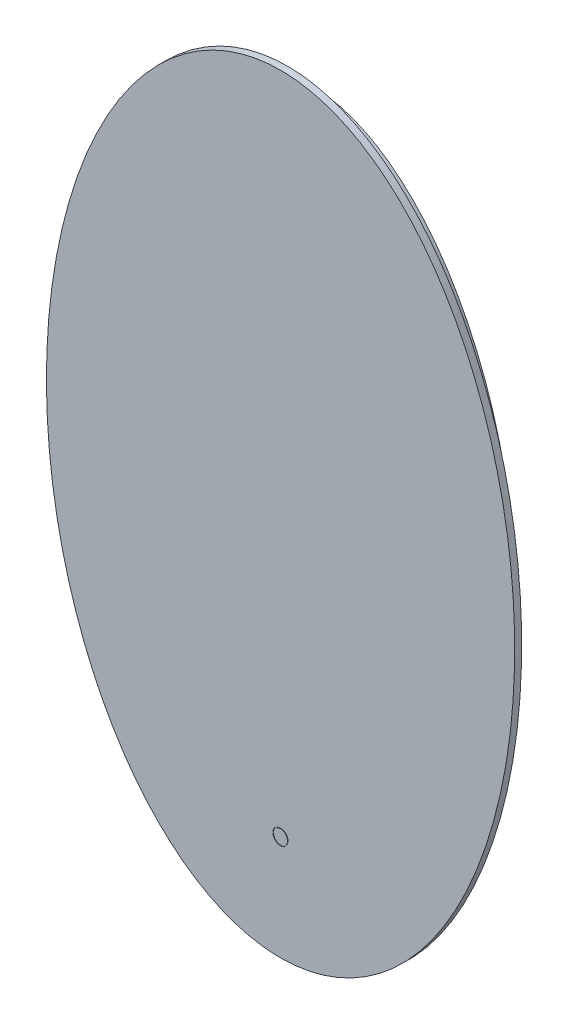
ISO-10303-21;
HEADER;
FILE_DESCRIPTION(('STEP AP214'),'2;1');
FILE_NAME('part.step','',(''),(''),'','','');
FILE_SCHEMA(('AUTOMOTIVE_DESIGN { 1 0 10303 214 1 1 1 1 }'));
ENDSEC;
DATA;
#1=APPLICATION_CONTEXT('core data for automotive mechanical design processes');
#2=APPLICATION_PROTOCOL_DEFINITION('international standard','automotive_design',2000,#1);
#3=PRODUCT_CONTEXT('',#1,'mechanical');
#4=PRODUCT('Part','Part','',(#3));
#5=PRODUCT_RELATED_PRODUCT_CATEGORY('part','',(#4));
#6=PRODUCT_DEFINITION_FORMATION('','',#4);
#7=PRODUCT_DEFINITION_CONTEXT('part definition',#1,'design');
#8=PRODUCT_DEFINITION('design','',#6,#7);
#9=PRODUCT_DEFINITION_SHAPE('','',#8);
#10=(LENGTH_UNIT() NAMED_UNIT(*) SI_UNIT(.MILLI.,.METRE.));
#11=(NAMED_UNIT(*) PLANE_ANGLE_UNIT() SI_UNIT($,.RADIAN.));
#12=(NAMED_UNIT(*) SI_UNIT($,.STERADIAN.) SOLID_ANGLE_UNIT());
#13=UNCERTAINTY_MEASURE_WITH_UNIT(LENGTH_MEASURE(1.E-05),#10,'distance_accuracy_value','');
#14=(GEOMETRIC_REPRESENTATION_CONTEXT(3) GLOBAL_UNCERTAINTY_ASSIGNED_CONTEXT((#13)) GLOBAL_UNIT_ASSIGNED_CONTEXT((#10,
#11,#12)) REPRESENTATION_CONTEXT('',''));
#15=CARTESIAN_POINT('',(0.,0.,0.));
#16=DIRECTION('',(0.,0.,1.));
#17=DIRECTION('',(1.,0.,0.));
#18=AXIS2_PLACEMENT_3D('',#15,#16,#17);
#19=CARTESIAN_POINT('',(0.,0.,10.));
#20=DIRECTION('',(0.,0.,1.));
#21=DIRECTION('',(0.,-1.,0.));
#22=AXIS2_PLACEMENT_3D('',#19,#20,#21);
#23=ELLIPSE('',#22,550.,335.);
#24=DIRECTION('',(0.,0.,-1.));
#25=VECTOR('',#24,1.);
#26=SURFACE_OF_LINEAR_EXTRUSION('',#23,#25);
#27=CARTESIAN_POINT('',(0.,-550.,10.));
#28=VERTEX_POINT('',#27);
#29=EDGE_CURVE('E10',#28,#28,#23,.T.);
#30=ORIENTED_EDGE('',*,*,#29,.F.);
#31=EDGE_LOOP('',(#30));
#32=FACE_BOUND('',#31,.T.);
#33=CARTESIAN_POINT('',(0.,0.,0.));
#34=DIRECTION('',(0.,0.,1.));
#35=DIRECTION('',(0.,-1.,0.));
#36=AXIS2_PLACEMENT_3D('',#33,#34,#35);
#37=ELLIPSE('',#36,550.,335.);
#38=CARTESIAN_POINT('',(0.,-550.,0.));
#39=VERTEX_POINT('',#38);
#40=EDGE_CURVE('E48',#39,#39,#37,.T.);
#41=ORIENTED_EDGE('',*,*,#40,.T.);
#42=EDGE_LOOP('',(#41));
#43=FACE_BOUND('',#42,.T.);
#44=ADVANCED_FACE('F37',(#32,#43),#26,.F.);
#45=CARTESIAN_POINT('',(0.,0.,10.));
#46=DIRECTION('',(0.,0.,1.));
#47=DIRECTION('',(1.,0.,0.));
#48=AXIS2_PLACEMENT_3D('',#45,#46,#47);
#49=PLANE('',#48);
#50=CARTESIAN_POINT('',(0.,-400.,10.));
#51=DIRECTION('',(0.,0.,1.));
#52=DIRECTION('',(1.,0.,0.));
#53=AXIS2_PLACEMENT_3D('',#50,#51,#52);
#54=CIRCLE('',#53,11.);
#55=CARTESIAN_POINT('',(11.,-400.,10.));
#56=VERTEX_POINT('',#55);
#57=EDGE_CURVE('E139',#56,#56,#54,.T.);
#58=ORIENTED_EDGE('',*,*,#57,.F.);
#59=EDGE_LOOP('',(#58));
#60=FACE_BOUND('',#59,.T.);
#61=ORIENTED_EDGE('',*,*,#29,.T.);
#62=EDGE_LOOP('',(#61));
#63=FACE_BOUND('',#62,.T.);
#64=ADVANCED_FACE('F80',(#60,#63),#49,.T.);
#65=CARTESIAN_POINT('',(0.,0.,0.));
#66=DIRECTION('',(0.,0.,1.));
#67=DIRECTION('',(1.,0.,0.));
#68=AXIS2_PLACEMENT_3D('',#65,#66,#67);
#69=PLANE('',#68);
#70=CARTESIAN_POINT('',(0.,510.,0.));
#71=CARTESIAN_POINT('',(0.851802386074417,510.,0.));
#72=CARTESIAN_POINT('',(1.70516955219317,509.993347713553,0.));
#73=CARTESIAN_POINT('',(3.40813143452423,509.966806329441,0.));
#74=CARTESIAN_POINT('',(4.25887773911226,509.946917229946,0.));
#75=CARTESIAN_POINT('',(6.8089235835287,509.867492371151,0.));
#76=CARTESIAN_POINT('',(8.5060301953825,509.78820032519,0.));
#77=CARTESIAN_POINT('',(13.5886597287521,509.472032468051,0.));
#78=CARTESIAN_POINT('',(20.3423293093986,508.841736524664,0.));
#79=CARTESIAN_POINT('',(27.0504225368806,507.800839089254,0.));
#80=CARTESIAN_POINT('',(32.0646356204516,506.868301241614,0.));
#81=CARTESIAN_POINT('',(33.7332300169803,506.532140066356,0.));
#82=CARTESIAN_POINT('',(37.0648315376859,505.809481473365,0.));
#83=CARTESIAN_POINT('',(38.7253295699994,505.423467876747,0.));
#84=CARTESIAN_POINT('',(46.9719936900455,503.37997130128,0.));
#85=CARTESIAN_POINT('',(53.4200875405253,501.376862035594,0.));
#86=CARTESIAN_POINT('',(66.0475942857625,496.707549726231,0.));
#87=CARTESIAN_POINT('',(72.2269358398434,494.041170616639,0.));
#88=CARTESIAN_POINT('',(81.3110529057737,489.585287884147,0.));
#89=CARTESIAN_POINT('',(84.3082242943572,488.023813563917,0.));
#90=CARTESIAN_POINT('',(88.7593533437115,485.571461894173,0.));
#91=CARTESIAN_POINT('',(90.2356223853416,484.73564813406,0.));
#92=CARTESIAN_POINT('',(93.1735280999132,483.027908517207,0.));
#93=CARTESIAN_POINT('',(94.6362249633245,482.155276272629,0.));
#94=CARTESIAN_POINT('',(101.874624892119,477.727738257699,0.));
#95=CARTESIAN_POINT('',(107.456041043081,473.963539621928,0.));
#96=CARTESIAN_POINT('',(118.257472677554,466.051528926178,0.));
#97=CARTESIAN_POINT('',(123.477276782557,461.903492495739,0.));
#98=CARTESIAN_POINT('',(133.596835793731,453.267699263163,0.));
#99=CARTESIAN_POINT('',(138.496463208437,448.779807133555,0.));
#100=CARTESIAN_POINT('',(152.761879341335,434.856022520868,0.));
#101=CARTESIAN_POINT('',(161.696633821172,424.96260315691,0.));
#102=CARTESIAN_POINT('',(172.251523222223,411.944564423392,0.));
#103=CARTESIAN_POINT('',(174.33162073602,409.308178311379,0.));
#104=CARTESIAN_POINT('',(177.406886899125,405.305960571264,0.));
#105=CARTESIAN_POINT('',(178.424493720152,403.963946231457,0.));
#106=CARTESIAN_POINT('',(180.444962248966,401.264266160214,0.));
#107=CARTESIAN_POINT('',(181.448398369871,399.905800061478,0.));
#108=CARTESIAN_POINT('',(186.418186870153,393.090156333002,0.));
#109=CARTESIAN_POINT('',(190.248026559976,387.556306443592,0.));
#110=CARTESIAN_POINT('',(201.338578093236,370.732483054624,0.));
#111=CARTESIAN_POINT('',(208.202204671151,359.221284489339,0.));
#112=CARTESIAN_POINT('',(221.016526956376,335.690273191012,0.));
#113=CARTESIAN_POINT('',(226.966378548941,323.669990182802,0.));
#114=CARTESIAN_POINT('',(233.89159180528,308.35933339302,0.));
#115=CARTESIAN_POINT('',(235.250933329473,305.282883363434,0.));
#116=CARTESIAN_POINT('',(237.919349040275,299.101978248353,0.));
#117=CARTESIAN_POINT('',(239.229480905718,295.99490351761,0.));
#118=CARTESIAN_POINT('',(243.075644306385,286.657971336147,0.));
#119=CARTESIAN_POINT('',(245.528724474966,280.410248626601,0.));
#120=CARTESIAN_POINT('',(252.575844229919,261.602138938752,0.));
#121=CARTESIAN_POINT('',(256.858708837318,248.977007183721,0.));
#122=CARTESIAN_POINT('',(264.677638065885,223.57136036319,0.));
#123=CARTESIAN_POINT('',(268.213371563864,210.790776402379,0.));
#124=CARTESIAN_POINT('',(274.594206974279,185.085911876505,0.));
#125=CARTESIAN_POINT('',(277.439120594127,172.16159213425,0.));
#126=CARTESIAN_POINT('',(282.475595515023,146.177012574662,0.));
#127=CARTESIAN_POINT('',(284.667050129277,133.116730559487,0.));
#128=CARTESIAN_POINT('',(288.419220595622,106.86493155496,0.));
#129=CARTESIAN_POINT('',(289.979882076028,93.6734032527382,0.));
#130=CARTESIAN_POINT('',(292.480733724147,67.1612479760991,0.));
#131=CARTESIAN_POINT('',(293.420908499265,53.8406177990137,0.));
#132=CARTESIAN_POINT('',(294.365011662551,33.7626809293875,0.));
#133=CARTESIAN_POINT('',(294.601951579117,27.0469528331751,0.));
#134=CARTESIAN_POINT('',(294.918128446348,13.6472256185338,0.));
#135=CARTESIAN_POINT('',(294.99781398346,6.95711883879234,0.));
#136=CARTESIAN_POINT('',(295.004238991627,-13.0842517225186,0.));
#137=CARTESIAN_POINT('',(294.698690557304,-26.4066084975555,0.));
#138=CARTESIAN_POINT('',(293.473152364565,-52.974858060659,0.));
#139=CARTESIAN_POINT('',(292.553164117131,-66.2207510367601,0.));
#140=CARTESIAN_POINT('',(290.092909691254,-92.6353466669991,0.));
#141=CARTESIAN_POINT('',(288.552680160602,-105.804053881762,0.));
#142=CARTESIAN_POINT('',(284.83455062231,-132.062113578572,0.));
#143=CARTESIAN_POINT('',(282.656730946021,-145.151476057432,0.));
#144=CARTESIAN_POINT('',(277.632760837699,-171.247030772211,0.));
#145=CARTESIAN_POINT('',(274.786754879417,-184.253240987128,0.));
#146=CARTESIAN_POINT('',(269.981095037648,-203.695772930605,0.));
#147=CARTESIAN_POINT('',(268.289624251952,-210.165468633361,0.));
#148=CARTESIAN_POINT('',(265.612092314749,-219.852549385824,0.));
#149=CARTESIAN_POINT('',(264.69618246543,-223.078664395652,0.));
#150=CARTESIAN_POINT('',(262.816421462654,-229.52492837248,0.));
#151=CARTESIAN_POINT('',(261.851823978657,-232.747476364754,0.));
#152=CARTESIAN_POINT('',(256.916103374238,-248.811829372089,0.));
#153=CARTESIAN_POINT('',(252.611898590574,-261.497271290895,0.));
#154=CARTESIAN_POINT('',(243.244944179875,-286.513995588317,0.));
#155=CARTESIAN_POINT('',(238.182479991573,-298.845411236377,0.));
#156=CARTESIAN_POINT('',(227.226902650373,-323.120418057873,0.));
#157=CARTESIAN_POINT('',(221.334317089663,-335.06425556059,0.));
#158=CARTESIAN_POINT('',(208.609611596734,-358.513268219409,0.));
#159=CARTESIAN_POINT('',(201.778531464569,-370.018928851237,0.));
#160=CARTESIAN_POINT('',(192.547565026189,-384.077860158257,0.));
#161=CARTESIAN_POINT('',(190.666570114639,-386.873397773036,0.));
#162=CARTESIAN_POINT('',(186.831428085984,-392.430318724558,0.));
#163=CARTESIAN_POINT('',(184.883040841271,-395.183293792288,0.));
#164=CARTESIAN_POINT('',(178.948632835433,-403.354563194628,0.));
#165=CARTESIAN_POINT('',(174.870923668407,-408.68906967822,0.));
#166=CARTESIAN_POINT('',(166.455023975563,-419.115685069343,0.));
#167=CARTESIAN_POINT('',(162.116880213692,-424.207837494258,0.));
#168=CARTESIAN_POINT('',(153.157661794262,-434.128853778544,0.));
#169=CARTESIAN_POINT('',(148.536657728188,-438.957783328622,0.));
#170=CARTESIAN_POINT('',(138.982642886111,-448.325296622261,0.));
#171=CARTESIAN_POINT('',(134.049742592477,-452.863983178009,0.));
#172=CARTESIAN_POINT('',(126.387628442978,-459.427491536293,0.));
#173=CARTESIAN_POINT('',(123.789714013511,-461.574497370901,0.));
#174=CARTESIAN_POINT('',(118.500113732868,-465.781247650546,0.));
#175=CARTESIAN_POINT('',(115.80331926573,-467.844526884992,0.));
#176=CARTESIAN_POINT('',(107.625946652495,-473.847861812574,0.));
#177=CARTESIAN_POINT('',(102.045645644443,-477.613254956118,0.));
#178=CARTESIAN_POINT('',(90.6057121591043,-484.630100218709,0.));
#179=CARTESIAN_POINT('',(84.7461554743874,-487.881691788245,0.));
#180=CARTESIAN_POINT('',(72.7185653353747,-493.817309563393,0.));
#181=CARTESIAN_POINT('',(66.5506481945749,-496.501549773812,0.));
#182=CARTESIAN_POINT('',(58.6233847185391,-499.456917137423,0.));
#183=CARTESIAN_POINT('',(57.0270334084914,-500.027938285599,0.));
#184=CARTESIAN_POINT('',(53.8117846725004,-501.128498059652,0.));
#185=CARTESIAN_POINT('',(52.1959780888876,-501.656910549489,0.));
#186=CARTESIAN_POINT('',(47.3428679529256,-503.169521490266,0.));
#187=CARTESIAN_POINT('',(44.0923103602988,-504.083729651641,0.));
#188=CARTESIAN_POINT('',(34.2944453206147,-506.539157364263,0.));
#189=CARTESIAN_POINT('',(27.7009996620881,-507.793516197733,0.));
#190=CARTESIAN_POINT('',(14.3858256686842,-509.504646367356,0.));
#191=CARTESIAN_POINT('',(7.6641049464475,-509.961465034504,0.));
#192=CARTESIAN_POINT('',(-0.822609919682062,-510.006718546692,0.));
#193=CARTESIAN_POINT('',(-2.52711935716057,-509.989328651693,0.));
#194=CARTESIAN_POINT('',(-5.92404025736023,-509.901822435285,0.));
#195=CARTESIAN_POINT('',(-7.61760091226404,-509.831814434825,0.));
#196=CARTESIAN_POINT('',(-12.6838223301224,-509.544305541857,0.));
#197=CARTESIAN_POINT('',(-16.0420273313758,-509.249345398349,0.));
#198=CARTESIAN_POINT('',(-26.0605444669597,-508.063872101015,0.));
#199=CARTESIAN_POINT('',(-32.664826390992,-506.873128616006,0.));
#200=CARTESIAN_POINT('',(-45.7314145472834,-503.730884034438,0.));
#201=CARTESIAN_POINT('',(-52.1937144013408,-501.779348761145,0.));
#202=CARTESIAN_POINT('',(-64.9817071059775,-497.144287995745,0.));
#203=CARTESIAN_POINT('',(-71.1948493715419,-494.502292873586,0.));
#204=CARTESIAN_POINT('',(-83.3006797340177,-488.647365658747,0.));
#205=CARTESIAN_POINT('',(-89.1935682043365,-485.434074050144,0.));
#206=CARTESIAN_POINT('',(-100.69120663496,-478.492838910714,0.));
#207=CARTESIAN_POINT('',(-106.295870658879,-474.764741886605,0.));
#208=CARTESIAN_POINT('',(-113.136391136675,-469.809356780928,0.));
#209=CARTESIAN_POINT('',(-114.496213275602,-468.803487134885,0.));
#210=CARTESIAN_POINT('',(-117.199603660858,-466.762716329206,0.));
#211=CARTESIAN_POINT('',(-118.543965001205,-465.727155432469,0.));
#212=CARTESIAN_POINT('',(-122.537607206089,-462.590088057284,0.));
#213=CARTESIAN_POINT('',(-125.15232959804,-460.454667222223,0.));
#214=CARTESIAN_POINT('',(-132.862759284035,-453.924936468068,0.));
#215=CARTESIAN_POINT('',(-137.825073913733,-449.407476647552,0.));
#216=CARTESIAN_POINT('',(-147.433731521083,-440.080847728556,0.));
#217=CARTESIAN_POINT('',(-152.079957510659,-435.271570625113,0.));
#218=CARTESIAN_POINT('',(-161.086411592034,-425.388979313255,0.));
#219=CARTESIAN_POINT('',(-165.446565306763,-420.315596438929,0.));
#220=CARTESIAN_POINT('',(-173.903995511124,-409.926138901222,0.));
#221=CARTESIAN_POINT('',(-178.001222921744,-404.610018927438,0.));
#222=CARTESIAN_POINT('',(-183.963451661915,-396.46632555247,0.));
#223=CARTESIAN_POINT('',(-185.920223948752,-393.723476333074,0.));
#224=CARTESIAN_POINT('',(-188.810845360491,-389.568085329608,0.));
#225=CARTESIAN_POINT('',(-189.7673885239,-388.175458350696,0.));
#226=CARTESIAN_POINT('',(-191.662156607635,-385.382176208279,0.));
#227=CARTESIAN_POINT('',(-192.600720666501,-383.981049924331,0.));
#228=CARTESIAN_POINT('',(-200.970263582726,-371.331485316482,0.));
#229=CARTESIAN_POINT('',(-207.861696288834,-359.808672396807,0.));
#230=CARTESIAN_POINT('',(-220.710590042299,-336.288095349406,0.));
#231=CARTESIAN_POINT('',(-226.667076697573,-324.289835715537,0.));
#232=CARTESIAN_POINT('',(-237.749044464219,-299.870726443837,0.));
#233=CARTESIAN_POINT('',(-242.874028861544,-287.449624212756,0.));
#234=CARTESIAN_POINT('',(-248.803275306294,-271.68068643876,0.));
#235=CARTESIAN_POINT('',(-249.964594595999,-268.516234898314,0.));
#236=CARTESIAN_POINT('',(-252.233569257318,-262.182781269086,0.));
#237=CARTESIAN_POINT('',(-253.342098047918,-259.011476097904,0.));
#238=CARTESIAN_POINT('',(-256.592044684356,-249.484219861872,0.));
#239=CARTESIAN_POINT('',(-258.65788319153,-243.114938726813,0.));
#240=CARTESIAN_POINT('',(-264.568508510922,-223.956495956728,0.));
#241=CARTESIAN_POINT('',(-268.127116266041,-211.116860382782,0.));
#242=CARTESIAN_POINT('',(-274.54281904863,-185.313862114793,0.));
#243=CARTESIAN_POINT('',(-277.399701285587,-172.350461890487,0.));
#244=CARTESIAN_POINT('',(-282.453139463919,-146.307198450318,0.));
#245=CARTESIAN_POINT('',(-284.649573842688,-133.22731379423,0.));
#246=CARTESIAN_POINT('',(-288.407914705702,-106.955631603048,0.));
#247=CARTESIAN_POINT('',(-289.969756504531,-93.7638226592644,0.));
#248=CARTESIAN_POINT('',(-292.472003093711,-67.2706007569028,0.));
#249=CARTESIAN_POINT('',(-293.412383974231,-53.9691835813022,0.));
#250=CARTESIAN_POINT('',(-294.358123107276,-33.9350744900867,0.));
#251=CARTESIAN_POINT('',(-294.59581008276,-27.2433588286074,0.));
#252=CARTESIAN_POINT('',(-294.835370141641,-17.1851550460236,0.));
#253=CARTESIAN_POINT('',(-294.895722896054,-13.8289810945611,0.));
#254=CARTESIAN_POINT('',(-294.977254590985,-7.10972403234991,0.));
#255=CARTESIAN_POINT('',(-294.998377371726,-3.74978709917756,0.));
#256=CARTESIAN_POINT('',(-295.006040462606,13.0283952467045,0.));
#257=CARTESIAN_POINT('',(-294.699472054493,26.404841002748,0.));
#258=CARTESIAN_POINT('',(-293.468217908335,53.0666056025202,0.));
#259=CARTESIAN_POINT('',(-292.543527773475,66.3519237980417,0.));
#260=CARTESIAN_POINT('',(-290.072087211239,92.8308519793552,0.));
#261=CARTESIAN_POINT('',(-288.52536764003,106.024466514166,0.));
#262=CARTESIAN_POINT('',(-284.794389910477,132.31770546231,0.));
#263=CARTESIAN_POINT('',(-282.610205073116,145.417340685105,0.));
#264=CARTESIAN_POINT('',(-277.575757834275,171.518413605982,0.));
#265=CARTESIAN_POINT('',(-274.725629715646,184.519871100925,0.));
#266=CARTESIAN_POINT('',(-268.314669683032,210.418009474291,0.));
#267=CARTESIAN_POINT('',(-264.754071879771,223.314724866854,0.));
#268=CARTESIAN_POINT('',(-259.817848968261,239.36404710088,0.));
#269=CARTESIAN_POINT('',(-258.8062670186,242.570323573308,0.));
#270=CARTESIAN_POINT('',(-256.733112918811,248.975506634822,0.));
#271=CARTESIAN_POINT('',(-255.672108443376,252.172522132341,0.));
#272=CARTESIAN_POINT('',(-252.422383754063,261.722844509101,0.));
#273=CARTESIAN_POINT('',(-250.164129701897,268.044384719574,0.));
#274=CARTESIAN_POINT('',(-243.104680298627,286.868349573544,0.));
#275=CARTESIAN_POINT('',(-238.019732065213,299.230580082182,0.));
#276=CARTESIAN_POINT('',(-227.023111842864,323.546580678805,0.));
#277=CARTESIAN_POINT('',(-221.111938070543,335.500596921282,0.));
#278=CARTESIAN_POINT('',(-208.358441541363,358.948575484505,0.));
#279=CARTESIAN_POINT('',(-201.517095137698,370.443020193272,0.));
#280=CARTESIAN_POINT('',(-192.28290685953,384.473869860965,0.));
#281=CARTESIAN_POINT('',(-190.401757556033,387.263087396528,0.));
#282=CARTESIAN_POINT('',(-186.567443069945,392.805941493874,0.));
#283=CARTESIAN_POINT('',(-184.613182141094,395.561084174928,0.));
#284=CARTESIAN_POINT('',(-178.643657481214,403.760645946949,0.));
#285=CARTESIAN_POINT('',(-174.543550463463,409.109680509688,0.));
#286=CARTESIAN_POINT('',(-166.085800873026,419.556809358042,0.));
#287=CARTESIAN_POINT('',(-161.728201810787,424.654946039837,0.));
#288=CARTESIAN_POINT('',(-152.734168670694,434.57952512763,0.));
#289=CARTESIAN_POINT('',(-148.097799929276,439.406031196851,0.));
#290=CARTESIAN_POINT('',(-138.51866034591,448.760487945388,0.));
#291=CARTESIAN_POINT('',(-133.575991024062,453.288537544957,0.));
#292=CARTESIAN_POINT('',(-123.34797805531,462.010738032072,0.));
#293=CARTESIAN_POINT('',(-118.062799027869,466.205049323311,0.));
#294=CARTESIAN_POINT('',(-111.211625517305,471.209505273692,0.));
#295=CARTESIAN_POINT('',(-109.830872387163,472.197117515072,0.));
#296=CARTESIAN_POINT('',(-107.054826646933,474.140215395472,0.));
#297=CARTESIAN_POINT('',(-105.658509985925,475.096452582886,0.));
#298=CARTESIAN_POINT('',(-101.444176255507,477.918301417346,0.));
#299=CARTESIAN_POINT('',(-98.6007892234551,479.737075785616,0.));
#300=CARTESIAN_POINT('',(-89.9646502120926,484.997745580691,0.));
#301=CARTESIAN_POINT('',(-84.0662027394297,488.244509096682,0.));
#302=CARTESIAN_POINT('',(-71.9574138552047,494.162226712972,0.));
#303=CARTESIAN_POINT('',(-65.7471924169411,496.833402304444,0.));
#304=CARTESIAN_POINT('',(-52.9747378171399,501.525879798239,0.));
#305=CARTESIAN_POINT('',(-46.5195134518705,503.507001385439,0.));
#306=CARTESIAN_POINT('',(-33.4733073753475,506.70910468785,0.));
#307=CARTESIAN_POINT('',(-26.8811349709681,507.930556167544,0.));
#308=CARTESIAN_POINT('',(-13.5516848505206,509.575970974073,0.));
#309=CARTESIAN_POINT('',(-6.8144190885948,510.,0.));
#310=CARTESIAN_POINT('',(0.,510.,0.));
#311=B_SPLINE_CURVE_WITH_KNOTS('',3,(#70,#71,#72,#73,#74,#75,#76,#77,#78,#79,#80,#81,#82,#83,
#84,#85,#86,#87,#88,#89,#90,#91,#92,#93,#94,#95,#96,#97,#98,#99,#100,#101,#102,#103,#104,#105,
#106,#107,#108,#109,#110,#111,#112,#113,#114,#115,#116,#117,#118,#119,#120,#121,#122,#123,#124,
#125,#126,#127,#128,#129,#130,#131,#132,#133,#134,#135,#136,#137,#138,#139,#140,#141,#142,#143,
#144,#145,#146,#147,#148,#149,#150,#151,#152,#153,#154,#155,#156,#157,#158,#159,#160,#161,#162,
#163,#164,#165,#166,#167,#168,#169,#170,#171,#172,#173,#174,#175,#176,#177,#178,#179,#180,#181,
#182,#183,#184,#185,#186,#187,#188,#189,#190,#191,#192,#193,#194,#195,#196,#197,#198,#199,#200,
#201,#202,#203,#204,#205,#206,#207,#208,#209,#210,#211,#212,#213,#214,#215,#216,#217,#218,#219,
#220,#221,#222,#223,#224,#225,#226,#227,#228,#229,#230,#231,#232,#233,#234,#235,#236,#237,#238,
#239,#240,#241,#242,#243,#244,#245,#246,#247,#248,#249,#250,#251,#252,#253,#254,#255,#256,#257,
#258,#259,#260,#261,#262,#263,#264,#265,#266,#267,#268,#269,#270,#271,#272,#273,#274,#275,#276,
#277,#278,#279,#280,#281,#282,#283,#284,#285,#286,#287,#288,#289,#290,#291,#292,#293,#294,#295,
#296,#297,#298,#299,#300,#301,#302,#303,#304,#305,#306,#307,#308,#309,#310),.UNSPECIFIED.,.T.,
.F.,(4,2,2,2,1,2,2,2,2,2,2,2,2,2,2,2,2,2,2,2,2,2,2,2,2,2,2,2,2,2,2,2,2,2,2,2,2,2,2,2,2,2,2,2,2,
2,2,2,2,2,2,2,2,2,2,2,2,2,2,2,2,2,2,2,2,2,2,2,2,2,2,2,2,2,2,2,2,2,2,2,2,2,2,2,2,2,2,2,2,2,2,2,2,
2,2,2,2,2,2,2,2,2,2,2,2,2,2,2,2,2,2,2,2,2,2,2,2,2,2,2,4),(0.,0.0009765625,0.00195312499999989,
0.00390624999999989,0.00781249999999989,0.0117187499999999,0.0136718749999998,
0.0156249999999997,0.0234374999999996,0.0312499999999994,0.0351562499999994,0.0371093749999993,
0.0390624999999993,0.0468749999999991,0.054687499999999,0.0624999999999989,0.0781249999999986,
0.0820312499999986,0.0839843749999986,0.0859374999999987,0.0937499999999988,0.109374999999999,
0.124999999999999,0.128906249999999,0.132812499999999,0.140624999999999,0.156249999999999,
0.171874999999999,0.187499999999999,0.203124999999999,0.218749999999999,0.234375,0.2421875,0.25,
0.265625,0.28125,0.296875,0.3125,0.328125,0.3359375,0.33984375,0.34375,0.359375,0.375,0.390625,
0.40625,0.41015625,0.4140625,0.421875,0.4296875,0.4375,0.4453125,0.44921875,0.453125,0.4609375,
0.46875,0.4765625,0.478515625,0.48046875,0.484375,0.4921875,0.5,0.501953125,0.50390625,
0.5078125,0.515625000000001,0.523437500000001,0.531250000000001,0.539062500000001,
0.546875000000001,0.548828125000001,0.550781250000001,0.554687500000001,0.562500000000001,
0.570312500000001,0.578125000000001,0.585937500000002,0.589843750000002,0.591796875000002,
0.593750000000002,0.609375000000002,0.625000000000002,0.640625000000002,0.644531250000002,
0.648437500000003,0.656250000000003,0.671875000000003,0.687500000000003,0.703125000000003,
0.718750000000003,0.734375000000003,0.742187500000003,0.746093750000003,0.750000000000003,
0.765625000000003,0.781250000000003,0.796875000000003,0.812500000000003,0.828125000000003,
0.843750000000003,0.847656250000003,0.851562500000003,0.859375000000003,0.875000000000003,
0.890625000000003,0.906250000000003,0.910156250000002,0.914062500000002,0.921875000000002,
0.929687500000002,0.937500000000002,0.945312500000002,0.953125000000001,0.955078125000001,
0.957031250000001,0.960937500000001,0.968750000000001,0.976562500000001,0.984375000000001,
0.9921875,1.),.UNSPECIFIED.);
#312=CARTESIAN_POINT('',(0.,510.,0.));
#313=VERTEX_POINT('',#312);
#314=EDGE_CURVE('E66',#313,#313,#311,.F.);
#315=ORIENTED_EDGE('',*,*,#314,.T.);
#316=EDGE_LOOP('',(#315));
#317=FACE_BOUND('',#316,.T.);
#318=ORIENTED_EDGE('',*,*,#40,.F.);
#319=EDGE_LOOP('',(#318));
#320=FACE_BOUND('',#319,.T.);
#321=ADVANCED_FACE('F70',(#317,#320),#69,.F.);
#322=CARTESIAN_POINT('',(0.,510.,-33.));
#323=CARTESIAN_POINT('',(-6.8144190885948,510.,-33.));
#324=CARTESIAN_POINT('',(-13.5516848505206,509.575970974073,-33.));
#325=CARTESIAN_POINT('',(-26.8811349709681,507.930556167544,-33.));
#326=CARTESIAN_POINT('',(-33.4733073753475,506.70910468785,-33.));
#327=CARTESIAN_POINT('',(-46.5195134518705,503.507001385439,-33.));
#328=CARTESIAN_POINT('',(-52.9747378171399,501.525879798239,-33.));
#329=CARTESIAN_POINT('',(-65.7471924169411,496.833402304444,-33.));
#330=CARTESIAN_POINT('',(-71.9574138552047,494.162226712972,-33.));
#331=CARTESIAN_POINT('',(-84.0662027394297,488.244509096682,-33.));
#332=CARTESIAN_POINT('',(-89.9646502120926,484.997745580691,-33.));
#333=CARTESIAN_POINT('',(-98.6007892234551,479.737075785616,-33.));
#334=CARTESIAN_POINT('',(-101.444176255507,477.918301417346,-33.));
#335=CARTESIAN_POINT('',(-105.658509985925,475.096452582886,-33.));
#336=CARTESIAN_POINT('',(-107.054826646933,474.140215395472,-33.));
#337=CARTESIAN_POINT('',(-109.830872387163,472.197117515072,-33.));
#338=CARTESIAN_POINT('',(-111.211625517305,471.209505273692,-33.));
#339=CARTESIAN_POINT('',(-118.062799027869,466.205049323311,-33.));
#340=CARTESIAN_POINT('',(-123.34797805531,462.010738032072,-33.));
#341=CARTESIAN_POINT('',(-133.575991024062,453.288537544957,-33.));
#342=CARTESIAN_POINT('',(-138.51866034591,448.760487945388,-33.));
#343=CARTESIAN_POINT('',(-148.097799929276,439.406031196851,-33.));
#344=CARTESIAN_POINT('',(-152.734168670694,434.57952512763,-33.));
#345=CARTESIAN_POINT('',(-161.728201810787,424.654946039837,-33.));
#346=CARTESIAN_POINT('',(-166.085800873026,419.556809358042,-33.));
#347=CARTESIAN_POINT('',(-174.543550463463,409.109680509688,-33.));
#348=CARTESIAN_POINT('',(-178.643657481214,403.760645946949,-33.));
#349=CARTESIAN_POINT('',(-184.613182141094,395.561084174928,-33.));
#350=CARTESIAN_POINT('',(-186.567443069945,392.805941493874,-33.));
#351=CARTESIAN_POINT('',(-190.401757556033,387.263087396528,-33.));
#352=CARTESIAN_POINT('',(-192.28290685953,384.473869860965,-33.));
#353=CARTESIAN_POINT('',(-201.517095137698,370.443020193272,-33.));
#354=CARTESIAN_POINT('',(-208.358441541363,358.948575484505,-33.));
#355=CARTESIAN_POINT('',(-221.111938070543,335.500596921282,-33.));
#356=CARTESIAN_POINT('',(-227.023111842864,323.546580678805,-33.));
#357=CARTESIAN_POINT('',(-238.019732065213,299.230580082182,-33.));
#358=CARTESIAN_POINT('',(-243.104680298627,286.868349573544,-33.));
#359=CARTESIAN_POINT('',(-250.164129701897,268.044384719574,-33.));
#360=CARTESIAN_POINT('',(-252.422383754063,261.722844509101,-33.));
#361=CARTESIAN_POINT('',(-255.672108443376,252.172522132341,-33.));
#362=CARTESIAN_POINT('',(-256.733112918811,248.975506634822,-33.));
#363=CARTESIAN_POINT('',(-258.8062670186,242.570323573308,-33.));
#364=CARTESIAN_POINT('',(-259.817848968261,239.36404710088,-33.));
#365=CARTESIAN_POINT('',(-264.754071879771,223.314724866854,-33.));
#366=CARTESIAN_POINT('',(-268.314669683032,210.418009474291,-33.));
#367=CARTESIAN_POINT('',(-274.725629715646,184.519871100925,-33.));
#368=CARTESIAN_POINT('',(-277.575757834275,171.518413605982,-33.));
#369=CARTESIAN_POINT('',(-282.610205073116,145.417340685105,-33.));
#370=CARTESIAN_POINT('',(-284.794389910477,132.31770546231,-33.));
#371=CARTESIAN_POINT('',(-288.52536764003,106.024466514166,-33.));
#372=CARTESIAN_POINT('',(-290.072087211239,92.8308519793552,-33.));
#373=CARTESIAN_POINT('',(-292.543527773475,66.3519237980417,-33.));
#374=CARTESIAN_POINT('',(-293.468217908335,53.0666056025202,-33.));
#375=CARTESIAN_POINT('',(-294.699472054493,26.404841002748,-33.));
#376=CARTESIAN_POINT('',(-295.006040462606,13.0283952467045,-33.));
#377=CARTESIAN_POINT('',(-294.998377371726,-3.74978709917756,-33.));
#378=CARTESIAN_POINT('',(-294.977254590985,-7.10972403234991,-33.));
#379=CARTESIAN_POINT('',(-294.895722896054,-13.8289810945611,-33.));
#380=CARTESIAN_POINT('',(-294.835370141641,-17.1851550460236,-33.));
#381=CARTESIAN_POINT('',(-294.59581008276,-27.2433588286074,-33.));
#382=CARTESIAN_POINT('',(-294.358123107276,-33.9350744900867,-33.));
#383=CARTESIAN_POINT('',(-293.412383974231,-53.9691835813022,-33.));
#384=CARTESIAN_POINT('',(-292.472003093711,-67.2706007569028,-33.));
#385=CARTESIAN_POINT('',(-289.969756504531,-93.7638226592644,-33.));
#386=CARTESIAN_POINT('',(-288.407914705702,-106.955631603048,-33.));
#387=CARTESIAN_POINT('',(-284.649573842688,-133.22731379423,-33.));
#388=CARTESIAN_POINT('',(-282.453139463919,-146.307198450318,-33.));
#389=CARTESIAN_POINT('',(-277.399701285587,-172.350461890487,-33.));
#390=CARTESIAN_POINT('',(-274.54281904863,-185.313862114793,-33.));
#391=CARTESIAN_POINT('',(-268.127116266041,-211.116860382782,-33.));
#392=CARTESIAN_POINT('',(-264.568508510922,-223.956495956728,-33.));
#393=CARTESIAN_POINT('',(-258.65788319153,-243.114938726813,-33.));
#394=CARTESIAN_POINT('',(-256.592044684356,-249.484219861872,-33.));
#395=CARTESIAN_POINT('',(-253.342098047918,-259.011476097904,-33.));
#396=CARTESIAN_POINT('',(-252.233569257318,-262.182781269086,-33.));
#397=CARTESIAN_POINT('',(-249.964594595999,-268.516234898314,-33.));
#398=CARTESIAN_POINT('',(-248.803275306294,-271.68068643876,-33.));
#399=CARTESIAN_POINT('',(-242.874028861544,-287.449624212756,-33.));
#400=CARTESIAN_POINT('',(-237.749044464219,-299.870726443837,-33.));
#401=CARTESIAN_POINT('',(-226.667076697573,-324.289835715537,-33.));
#402=CARTESIAN_POINT('',(-220.710590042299,-336.288095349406,-33.));
#403=CARTESIAN_POINT('',(-207.861696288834,-359.808672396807,-33.));
#404=CARTESIAN_POINT('',(-200.970263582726,-371.331485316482,-33.));
#405=CARTESIAN_POINT('',(-192.600720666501,-383.981049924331,-33.));
#406=CARTESIAN_POINT('',(-191.662156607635,-385.382176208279,-33.));
#407=CARTESIAN_POINT('',(-189.7673885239,-388.175458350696,-33.));
#408=CARTESIAN_POINT('',(-188.810845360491,-389.568085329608,-33.));
#409=CARTESIAN_POINT('',(-185.920223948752,-393.723476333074,-33.));
#410=CARTESIAN_POINT('',(-183.963451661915,-396.46632555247,-33.));
#411=CARTESIAN_POINT('',(-178.001222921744,-404.610018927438,-33.));
#412=CARTESIAN_POINT('',(-173.903995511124,-409.926138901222,-33.));
#413=CARTESIAN_POINT('',(-165.446565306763,-420.315596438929,-33.));
#414=CARTESIAN_POINT('',(-161.086411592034,-425.388979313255,-33.));
#415=CARTESIAN_POINT('',(-152.079957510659,-435.271570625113,-33.));
#416=CARTESIAN_POINT('',(-147.433731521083,-440.080847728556,-33.));
#417=CARTESIAN_POINT('',(-137.825073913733,-449.407476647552,-33.));
#418=CARTESIAN_POINT('',(-132.862759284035,-453.924936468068,-33.));
#419=CARTESIAN_POINT('',(-125.15232959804,-460.454667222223,-33.));
#420=CARTESIAN_POINT('',(-122.537607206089,-462.590088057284,-33.));
#421=CARTESIAN_POINT('',(-118.543965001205,-465.727155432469,-33.));
#422=CARTESIAN_POINT('',(-117.199603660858,-466.762716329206,-33.));
#423=CARTESIAN_POINT('',(-114.496213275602,-468.803487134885,-33.));
#424=CARTESIAN_POINT('',(-113.136391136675,-469.809356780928,-33.));
#425=CARTESIAN_POINT('',(-106.295870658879,-474.764741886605,-33.));
#426=CARTESIAN_POINT('',(-100.69120663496,-478.492838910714,-33.));
#427=CARTESIAN_POINT('',(-89.1935682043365,-485.434074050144,-33.));
#428=CARTESIAN_POINT('',(-83.3006797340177,-488.647365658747,-33.));
#429=CARTESIAN_POINT('',(-71.1948493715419,-494.502292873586,-33.));
#430=CARTESIAN_POINT('',(-64.9817071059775,-497.144287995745,-33.));
#431=CARTESIAN_POINT('',(-52.1937144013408,-501.779348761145,-33.));
#432=CARTESIAN_POINT('',(-45.7314145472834,-503.730884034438,-33.));
#433=CARTESIAN_POINT('',(-32.664826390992,-506.873128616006,-33.));
#434=CARTESIAN_POINT('',(-26.0605444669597,-508.063872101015,-33.));
#435=CARTESIAN_POINT('',(-16.0420273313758,-509.249345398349,-33.));
#436=CARTESIAN_POINT('',(-12.6838223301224,-509.544305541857,-33.));
#437=CARTESIAN_POINT('',(-7.61760091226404,-509.831814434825,-33.));
#438=CARTESIAN_POINT('',(-5.92404025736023,-509.901822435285,-33.));
#439=CARTESIAN_POINT('',(-2.52711935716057,-509.989328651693,-33.));
#440=CARTESIAN_POINT('',(-0.822609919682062,-510.006718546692,-33.));
#441=CARTESIAN_POINT('',(7.6641049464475,-509.961465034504,-33.));
#442=CARTESIAN_POINT('',(14.3858256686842,-509.504646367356,-33.));
#443=CARTESIAN_POINT('',(27.7009996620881,-507.793516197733,-33.));
#444=CARTESIAN_POINT('',(34.2944453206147,-506.539157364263,-33.));
#445=CARTESIAN_POINT('',(44.0923103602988,-504.083729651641,-33.));
#446=CARTESIAN_POINT('',(47.3428679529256,-503.169521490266,-33.));
#447=CARTESIAN_POINT('',(52.1959780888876,-501.656910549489,-33.));
#448=CARTESIAN_POINT('',(53.8117846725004,-501.128498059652,-33.));
#449=CARTESIAN_POINT('',(57.0270334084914,-500.027938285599,-33.));
#450=CARTESIAN_POINT('',(58.6233847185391,-499.456917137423,-33.));
#451=CARTESIAN_POINT('',(66.5506481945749,-496.501549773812,-33.));
#452=CARTESIAN_POINT('',(72.7185653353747,-493.817309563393,-33.));
#453=CARTESIAN_POINT('',(84.7461554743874,-487.881691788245,-33.));
#454=CARTESIAN_POINT('',(90.6057121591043,-484.630100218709,-33.));
#455=CARTESIAN_POINT('',(102.045645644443,-477.613254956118,-33.));
#456=CARTESIAN_POINT('',(107.625946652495,-473.847861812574,-33.));
#457=CARTESIAN_POINT('',(115.80331926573,-467.844526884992,-33.));
#458=CARTESIAN_POINT('',(118.500113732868,-465.781247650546,-33.));
#459=CARTESIAN_POINT('',(123.789714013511,-461.574497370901,-33.));
#460=CARTESIAN_POINT('',(126.387628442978,-459.427491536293,-33.));
#461=CARTESIAN_POINT('',(134.049742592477,-452.863983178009,-33.));
#462=CARTESIAN_POINT('',(138.982642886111,-448.325296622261,-33.));
#463=CARTESIAN_POINT('',(148.536657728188,-438.957783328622,-33.));
#464=CARTESIAN_POINT('',(153.157661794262,-434.128853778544,-33.));
#465=CARTESIAN_POINT('',(162.116880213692,-424.207837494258,-33.));
#466=CARTESIAN_POINT('',(166.455023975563,-419.115685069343,-33.));
#467=CARTESIAN_POINT('',(174.870923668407,-408.68906967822,-33.));
#468=CARTESIAN_POINT('',(178.948632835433,-403.354563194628,-33.));
#469=CARTESIAN_POINT('',(184.883040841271,-395.183293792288,-33.));
#470=CARTESIAN_POINT('',(186.831428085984,-392.430318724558,-33.));
#471=CARTESIAN_POINT('',(190.666570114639,-386.873397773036,-33.));
#472=CARTESIAN_POINT('',(192.547565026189,-384.077860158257,-33.));
#473=CARTESIAN_POINT('',(201.778531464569,-370.018928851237,-33.));
#474=CARTESIAN_POINT('',(208.609611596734,-358.513268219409,-33.));
#475=CARTESIAN_POINT('',(221.334317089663,-335.06425556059,-33.));
#476=CARTESIAN_POINT('',(227.226902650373,-323.120418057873,-33.));
#477=CARTESIAN_POINT('',(238.182479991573,-298.845411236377,-33.));
#478=CARTESIAN_POINT('',(243.244944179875,-286.513995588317,-33.));
#479=CARTESIAN_POINT('',(252.611898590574,-261.497271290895,-33.));
#480=CARTESIAN_POINT('',(256.916103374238,-248.811829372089,-33.));
#481=CARTESIAN_POINT('',(261.851823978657,-232.747476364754,-33.));
#482=CARTESIAN_POINT('',(262.816421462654,-229.52492837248,-33.));
#483=CARTESIAN_POINT('',(264.69618246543,-223.078664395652,-33.));
#484=CARTESIAN_POINT('',(265.612092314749,-219.852549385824,-33.));
#485=CARTESIAN_POINT('',(268.289624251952,-210.165468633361,-33.));
#486=CARTESIAN_POINT('',(269.981095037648,-203.695772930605,-33.));
#487=CARTESIAN_POINT('',(274.786754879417,-184.253240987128,-33.));
#488=CARTESIAN_POINT('',(277.632760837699,-171.247030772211,-33.));
#489=CARTESIAN_POINT('',(282.656730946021,-145.151476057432,-33.));
#490=CARTESIAN_POINT('',(284.83455062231,-132.062113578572,-33.));
#491=CARTESIAN_POINT('',(288.552680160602,-105.804053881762,-33.));
#492=CARTESIAN_POINT('',(290.092909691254,-92.6353466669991,-33.));
#493=CARTESIAN_POINT('',(292.553164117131,-66.2207510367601,-33.));
#494=CARTESIAN_POINT('',(293.473152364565,-52.974858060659,-33.));
#495=CARTESIAN_POINT('',(294.698690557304,-26.4066084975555,-33.));
#496=CARTESIAN_POINT('',(295.004238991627,-13.0842517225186,-33.));
#497=CARTESIAN_POINT('',(294.99781398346,6.95711883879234,-33.));
#498=CARTESIAN_POINT('',(294.918128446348,13.6472256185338,-33.));
#499=CARTESIAN_POINT('',(294.601951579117,27.0469528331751,-33.));
#500=CARTESIAN_POINT('',(294.365011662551,33.7626809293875,-33.));
#501=CARTESIAN_POINT('',(293.420908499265,53.8406177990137,-33.));
#502=CARTESIAN_POINT('',(292.480733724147,67.1612479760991,-33.));
#503=CARTESIAN_POINT('',(289.979882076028,93.6734032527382,-33.));
#504=CARTESIAN_POINT('',(288.419220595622,106.86493155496,-33.));
#505=CARTESIAN_POINT('',(284.667050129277,133.116730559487,-33.));
#506=CARTESIAN_POINT('',(282.475595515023,146.177012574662,-33.));
#507=CARTESIAN_POINT('',(277.439120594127,172.16159213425,-33.));
#508=CARTESIAN_POINT('',(274.594206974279,185.085911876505,-33.));
#509=CARTESIAN_POINT('',(268.213371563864,210.790776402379,-33.));
#510=CARTESIAN_POINT('',(264.677638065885,223.57136036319,-33.));
#511=CARTESIAN_POINT('',(256.858708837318,248.977007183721,-33.));
#512=CARTESIAN_POINT('',(252.575844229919,261.602138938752,-33.));
#513=CARTESIAN_POINT('',(245.528724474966,280.410248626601,-33.));
#514=CARTESIAN_POINT('',(243.075644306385,286.657971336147,-33.));
#515=CARTESIAN_POINT('',(239.229480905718,295.99490351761,-33.));
#516=CARTESIAN_POINT('',(237.919349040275,299.101978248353,-33.));
#517=CARTESIAN_POINT('',(235.250933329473,305.282883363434,-33.));
#518=CARTESIAN_POINT('',(233.89159180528,308.35933339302,-33.));
#519=CARTESIAN_POINT('',(226.966378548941,323.669990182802,-33.));
#520=CARTESIAN_POINT('',(221.016526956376,335.690273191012,-33.));
#521=CARTESIAN_POINT('',(208.202204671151,359.221284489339,-33.));
#522=CARTESIAN_POINT('',(201.338578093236,370.732483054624,-33.));
#523=CARTESIAN_POINT('',(190.248026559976,387.556306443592,-33.));
#524=CARTESIAN_POINT('',(186.418186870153,393.090156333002,-33.));
#525=CARTESIAN_POINT('',(181.448398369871,399.905800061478,-33.));
#526=CARTESIAN_POINT('',(180.444962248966,401.264266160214,-33.));
#527=CARTESIAN_POINT('',(178.424493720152,403.963946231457,-33.));
#528=CARTESIAN_POINT('',(177.406886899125,405.305960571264,-33.));
#529=CARTESIAN_POINT('',(174.33162073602,409.308178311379,-33.));
#530=CARTESIAN_POINT('',(172.251523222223,411.944564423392,-33.));
#531=CARTESIAN_POINT('',(161.696633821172,424.96260315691,-33.));
#532=CARTESIAN_POINT('',(152.761879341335,434.856022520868,-33.));
#533=CARTESIAN_POINT('',(138.496463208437,448.779807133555,-33.));
#534=CARTESIAN_POINT('',(133.596835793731,453.267699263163,-33.));
#535=CARTESIAN_POINT('',(123.477276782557,461.903492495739,-33.));
#536=CARTESIAN_POINT('',(118.257472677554,466.051528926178,-33.));
#537=CARTESIAN_POINT('',(107.456041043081,473.963539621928,-33.));
#538=CARTESIAN_POINT('',(101.874624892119,477.727738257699,-33.));
#539=CARTESIAN_POINT('',(94.6362249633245,482.155276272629,-33.));
#540=CARTESIAN_POINT('',(93.1735280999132,483.027908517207,-33.));
#541=CARTESIAN_POINT('',(90.2356223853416,484.73564813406,-33.));
#542=CARTESIAN_POINT('',(88.7593533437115,485.571461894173,-33.));
#543=CARTESIAN_POINT('',(84.3082242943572,488.023813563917,-33.));
#544=CARTESIAN_POINT('',(81.3110529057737,489.585287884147,-33.));
#545=CARTESIAN_POINT('',(72.2269358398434,494.041170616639,-33.));
#546=CARTESIAN_POINT('',(66.0475942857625,496.707549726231,-33.));
#547=CARTESIAN_POINT('',(53.4200875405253,501.376862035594,-33.));
#548=CARTESIAN_POINT('',(46.9719936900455,503.37997130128,-33.));
#549=CARTESIAN_POINT('',(38.7253295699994,505.423467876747,-33.));
#550=CARTESIAN_POINT('',(37.0648315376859,505.809481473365,-33.));
#551=CARTESIAN_POINT('',(33.7332300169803,506.532140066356,-33.));
#552=CARTESIAN_POINT('',(32.0646356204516,506.868301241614,-33.));
#553=CARTESIAN_POINT('',(27.0504225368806,507.800839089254,-33.));
#554=CARTESIAN_POINT('',(20.3423293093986,508.841736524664,-33.));
#555=CARTESIAN_POINT('',(13.5886597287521,509.472032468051,-33.));
#556=CARTESIAN_POINT('',(8.5060301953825,509.78820032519,-33.));
#557=CARTESIAN_POINT('',(6.8089235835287,509.867492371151,-33.));
#558=CARTESIAN_POINT('',(4.25887773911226,509.946917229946,-33.));
#559=CARTESIAN_POINT('',(3.40813143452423,509.966806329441,-33.));
#560=CARTESIAN_POINT('',(1.70516955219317,509.993347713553,-33.));
#561=CARTESIAN_POINT('',(0.851802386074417,510.,-33.));
#562=CARTESIAN_POINT('',(0.,510.,-33.));
#563=B_SPLINE_CURVE_WITH_KNOTS('',3,(#322,#323,#324,#325,#326,#327,#328,#329,#330,#331,#332,
#333,#334,#335,#336,#337,#338,#339,#340,#341,#342,#343,#344,#345,#346,#347,#348,#349,#350,#351,
#352,#353,#354,#355,#356,#357,#358,#359,#360,#361,#362,#363,#364,#365,#366,#367,#368,#369,#370,
#371,#372,#373,#374,#375,#376,#377,#378,#379,#380,#381,#382,#383,#384,#385,#386,#387,#388,#389,
#390,#391,#392,#393,#394,#395,#396,#397,#398,#399,#400,#401,#402,#403,#404,#405,#406,#407,#408,
#409,#410,#411,#412,#413,#414,#415,#416,#417,#418,#419,#420,#421,#422,#423,#424,#425,#426,#427,
#428,#429,#430,#431,#432,#433,#434,#435,#436,#437,#438,#439,#440,#441,#442,#443,#444,#445,#446,
#447,#448,#449,#450,#451,#452,#453,#454,#455,#456,#457,#458,#459,#460,#461,#462,#463,#464,#465,
#466,#467,#468,#469,#470,#471,#472,#473,#474,#475,#476,#477,#478,#479,#480,#481,#482,#483,#484,
#485,#486,#487,#488,#489,#490,#491,#492,#493,#494,#495,#496,#497,#498,#499,#500,#501,#502,#503,
#504,#505,#506,#507,#508,#509,#510,#511,#512,#513,#514,#515,#516,#517,#518,#519,#520,#521,#522,
#523,#524,#525,#526,#527,#528,#529,#530,#531,#532,#533,#534,#535,#536,#537,#538,#539,#540,#541,
#542,#543,#544,#545,#546,#547,#548,#549,#550,#551,#552,#553,#554,#555,#556,#557,#558,#559,#560,
#561,#562),.UNSPECIFIED.,.T.,.F.,(4,2,2,2,2,2,2,2,2,2,2,2,2,2,2,2,2,2,2,2,2,2,2,2,2,2,2,2,2,2,2,
2,2,2,2,2,2,2,2,2,2,2,2,2,2,2,2,2,2,2,2,2,2,2,2,2,2,2,2,2,2,2,2,2,2,2,2,2,2,2,2,2,2,2,2,2,2,2,2,
2,2,2,2,2,2,2,2,2,2,2,2,2,2,2,2,2,2,2,2,2,2,2,2,2,2,2,2,2,2,2,2,2,2,2,2,2,1,2,2,2,4),(0.,
0.00781249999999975,0.0156249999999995,0.0234374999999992,0.031249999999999,0.0390624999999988,
0.0429687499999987,0.0449218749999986,0.0468749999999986,0.0546874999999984,0.0624999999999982,
0.070312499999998,0.0781249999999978,0.0859374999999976,0.0898437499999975,0.0937499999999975,
0.109374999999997,0.124999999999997,0.140624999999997,0.148437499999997,0.152343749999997,
0.156249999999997,0.171874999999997,0.187499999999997,0.203124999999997,0.218749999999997,
0.234374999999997,0.249999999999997,0.253906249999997,0.257812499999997,0.265624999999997,
0.281249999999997,0.296874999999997,0.312499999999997,0.328124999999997,0.343749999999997,
0.351562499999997,0.355468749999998,0.359374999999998,0.374999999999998,0.390624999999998,
0.406249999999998,0.408203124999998,0.410156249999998,0.414062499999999,0.421874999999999,
0.429687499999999,0.437499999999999,0.445312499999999,0.449218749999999,0.451171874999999,
0.453124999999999,0.460937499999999,0.468749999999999,0.476562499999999,0.484374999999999,
0.4921875,0.49609375,0.498046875,0.5,0.5078125,0.515625,0.51953125,0.521484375,0.5234375,
0.53125,0.5390625,0.546875,0.55078125,0.5546875,0.5625,0.5703125,0.578125,0.5859375,0.58984375,
0.59375,0.609375,0.625,0.640625,0.65625,0.66015625,0.6640625,0.671875,0.6875,0.703125,0.71875,
0.734375,0.75,0.7578125,0.765625,0.781250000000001,0.796875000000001,0.812500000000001,
0.828125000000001,0.843750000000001,0.859375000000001,0.867187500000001,0.871093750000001,
0.875000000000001,0.890625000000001,0.906250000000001,0.914062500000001,0.916015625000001,
0.917968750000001,0.921875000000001,0.937500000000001,0.945312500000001,0.953125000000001,
0.960937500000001,0.962890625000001,0.964843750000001,0.968750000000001,0.9765625,0.984375,
0.986328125,0.98828125,0.9921875,0.99609375,0.998046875,0.9990234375,1.),.UNSPECIFIED.);
#564=DIRECTION('',(0.,0.,1.));
#565=VECTOR('',#564,1.);
#566=SURFACE_OF_LINEAR_EXTRUSION('',#563,#565);
#567=CARTESIAN_POINT('',(0.,510.,-33.));
#568=CARTESIAN_POINT('',(-6.8144190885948,510.,-33.));
#569=CARTESIAN_POINT('',(-13.5516848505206,509.575970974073,-33.));
#570=CARTESIAN_POINT('',(-26.8811349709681,507.930556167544,-33.));
#571=CARTESIAN_POINT('',(-33.4733073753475,506.70910468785,-33.));
#572=CARTESIAN_POINT('',(-46.5195134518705,503.507001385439,-33.));
#573=CARTESIAN_POINT('',(-52.9747378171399,501.525879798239,-33.));
#574=CARTESIAN_POINT('',(-65.7471924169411,496.833402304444,-33.));
#575=CARTESIAN_POINT('',(-71.9574138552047,494.162226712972,-33.));
#576=CARTESIAN_POINT('',(-84.0662027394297,488.244509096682,-33.));
#577=CARTESIAN_POINT('',(-89.9646502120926,484.997745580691,-33.));
#578=CARTESIAN_POINT('',(-98.6007892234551,479.737075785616,-33.));
#579=CARTESIAN_POINT('',(-101.444176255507,477.918301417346,-33.));
#580=CARTESIAN_POINT('',(-105.658509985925,475.096452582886,-33.));
#581=CARTESIAN_POINT('',(-107.054826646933,474.140215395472,-33.));
#582=CARTESIAN_POINT('',(-109.830872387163,472.197117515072,-33.));
#583=CARTESIAN_POINT('',(-111.211625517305,471.209505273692,-33.));
#584=CARTESIAN_POINT('',(-118.062799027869,466.205049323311,-33.));
#585=CARTESIAN_POINT('',(-123.34797805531,462.010738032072,-33.));
#586=CARTESIAN_POINT('',(-133.575991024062,453.288537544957,-33.));
#587=CARTESIAN_POINT('',(-138.51866034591,448.760487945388,-33.));
#588=CARTESIAN_POINT('',(-148.097799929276,439.406031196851,-33.));
#589=CARTESIAN_POINT('',(-152.734168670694,434.57952512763,-33.));
#590=CARTESIAN_POINT('',(-161.728201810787,424.654946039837,-33.));
#591=CARTESIAN_POINT('',(-166.085800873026,419.556809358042,-33.));
#592=CARTESIAN_POINT('',(-174.543550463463,409.109680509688,-33.));
#593=CARTESIAN_POINT('',(-178.643657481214,403.760645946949,-33.));
#594=CARTESIAN_POINT('',(-184.613182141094,395.561084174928,-33.));
#595=CARTESIAN_POINT('',(-186.567443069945,392.805941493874,-33.));
#596=CARTESIAN_POINT('',(-190.401757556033,387.263087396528,-33.));
#597=CARTESIAN_POINT('',(-192.28290685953,384.473869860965,-33.));
#598=CARTESIAN_POINT('',(-201.517095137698,370.443020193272,-33.));
#599=CARTESIAN_POINT('',(-208.358441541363,358.948575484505,-33.));
#600=CARTESIAN_POINT('',(-221.111938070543,335.500596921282,-33.));
#601=CARTESIAN_POINT('',(-227.023111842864,323.546580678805,-33.));
#602=CARTESIAN_POINT('',(-238.019732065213,299.230580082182,-33.));
#603=CARTESIAN_POINT('',(-243.104680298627,286.868349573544,-33.));
#604=CARTESIAN_POINT('',(-250.164129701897,268.044384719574,-33.));
#605=CARTESIAN_POINT('',(-252.422383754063,261.722844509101,-33.));
#606=CARTESIAN_POINT('',(-255.672108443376,252.172522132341,-33.));
#607=CARTESIAN_POINT('',(-256.733112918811,248.975506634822,-33.));
#608=CARTESIAN_POINT('',(-258.8062670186,242.570323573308,-33.));
#609=CARTESIAN_POINT('',(-259.817848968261,239.36404710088,-33.));
#610=CARTESIAN_POINT('',(-264.754071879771,223.314724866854,-33.));
#611=CARTESIAN_POINT('',(-268.314669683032,210.418009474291,-33.));
#612=CARTESIAN_POINT('',(-274.725629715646,184.519871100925,-33.));
#613=CARTESIAN_POINT('',(-277.575757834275,171.518413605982,-33.));
#614=CARTESIAN_POINT('',(-282.610205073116,145.417340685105,-33.));
#615=CARTESIAN_POINT('',(-284.794389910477,132.31770546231,-33.));
#616=CARTESIAN_POINT('',(-288.52536764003,106.024466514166,-33.));
#617=CARTESIAN_POINT('',(-290.072087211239,92.8308519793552,-33.));
#618=CARTESIAN_POINT('',(-292.543527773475,66.3519237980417,-33.));
#619=CARTESIAN_POINT('',(-293.468217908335,53.0666056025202,-33.));
#620=CARTESIAN_POINT('',(-294.699472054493,26.404841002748,-33.));
#621=CARTESIAN_POINT('',(-295.006040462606,13.0283952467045,-33.));
#622=CARTESIAN_POINT('',(-294.998377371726,-3.74978709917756,-33.));
#623=CARTESIAN_POINT('',(-294.977254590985,-7.10972403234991,-33.));
#624=CARTESIAN_POINT('',(-294.895722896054,-13.8289810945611,-33.));
#625=CARTESIAN_POINT('',(-294.835370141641,-17.1851550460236,-33.));
#626=CARTESIAN_POINT('',(-294.59581008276,-27.2433588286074,-33.));
#627=CARTESIAN_POINT('',(-294.358123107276,-33.9350744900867,-33.));
#628=CARTESIAN_POINT('',(-293.412383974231,-53.9691835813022,-33.));
#629=CARTESIAN_POINT('',(-292.472003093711,-67.2706007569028,-33.));
#630=CARTESIAN_POINT('',(-289.969756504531,-93.7638226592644,-33.));
#631=CARTESIAN_POINT('',(-288.407914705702,-106.955631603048,-33.));
#632=CARTESIAN_POINT('',(-284.649573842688,-133.22731379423,-33.));
#633=CARTESIAN_POINT('',(-282.453139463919,-146.307198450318,-33.));
#634=CARTESIAN_POINT('',(-277.399701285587,-172.350461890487,-33.));
#635=CARTESIAN_POINT('',(-274.54281904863,-185.313862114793,-33.));
#636=CARTESIAN_POINT('',(-268.127116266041,-211.116860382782,-33.));
#637=CARTESIAN_POINT('',(-264.568508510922,-223.956495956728,-33.));
#638=CARTESIAN_POINT('',(-258.65788319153,-243.114938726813,-33.));
#639=CARTESIAN_POINT('',(-256.592044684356,-249.484219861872,-33.));
#640=CARTESIAN_POINT('',(-253.342098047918,-259.011476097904,-33.));
#641=CARTESIAN_POINT('',(-252.233569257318,-262.182781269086,-33.));
#642=CARTESIAN_POINT('',(-249.964594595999,-268.516234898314,-33.));
#643=CARTESIAN_POINT('',(-248.803275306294,-271.68068643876,-33.));
#644=CARTESIAN_POINT('',(-242.874028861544,-287.449624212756,-33.));
#645=CARTESIAN_POINT('',(-237.749044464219,-299.870726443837,-33.));
#646=CARTESIAN_POINT('',(-226.667076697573,-324.289835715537,-33.));
#647=CARTESIAN_POINT('',(-220.710590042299,-336.288095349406,-33.));
#648=CARTESIAN_POINT('',(-207.861696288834,-359.808672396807,-33.));
#649=CARTESIAN_POINT('',(-200.970263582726,-371.331485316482,-33.));
#650=CARTESIAN_POINT('',(-192.600720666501,-383.981049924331,-33.));
#651=CARTESIAN_POINT('',(-191.662156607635,-385.382176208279,-33.));
#652=CARTESIAN_POINT('',(-189.7673885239,-388.175458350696,-33.));
#653=CARTESIAN_POINT('',(-188.810845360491,-389.568085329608,-33.));
#654=CARTESIAN_POINT('',(-185.920223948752,-393.723476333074,-33.));
#655=CARTESIAN_POINT('',(-183.963451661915,-396.46632555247,-33.));
#656=CARTESIAN_POINT('',(-178.001222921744,-404.610018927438,-33.));
#657=CARTESIAN_POINT('',(-173.903995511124,-409.926138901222,-33.));
#658=CARTESIAN_POINT('',(-165.446565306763,-420.315596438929,-33.));
#659=CARTESIAN_POINT('',(-161.086411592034,-425.388979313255,-33.));
#660=CARTESIAN_POINT('',(-152.079957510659,-435.271570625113,-33.));
#661=CARTESIAN_POINT('',(-147.433731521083,-440.080847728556,-33.));
#662=CARTESIAN_POINT('',(-137.825073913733,-449.407476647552,-33.));
#663=CARTESIAN_POINT('',(-132.862759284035,-453.924936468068,-33.));
#664=CARTESIAN_POINT('',(-125.15232959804,-460.454667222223,-33.));
#665=CARTESIAN_POINT('',(-122.537607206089,-462.590088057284,-33.));
#666=CARTESIAN_POINT('',(-118.543965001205,-465.727155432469,-33.));
#667=CARTESIAN_POINT('',(-117.199603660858,-466.762716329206,-33.));
#668=CARTESIAN_POINT('',(-114.496213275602,-468.803487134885,-33.));
#669=CARTESIAN_POINT('',(-113.136391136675,-469.809356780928,-33.));
#670=CARTESIAN_POINT('',(-106.295870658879,-474.764741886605,-33.));
#671=CARTESIAN_POINT('',(-100.69120663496,-478.492838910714,-33.));
#672=CARTESIAN_POINT('',(-89.1935682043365,-485.434074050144,-33.));
#673=CARTESIAN_POINT('',(-83.3006797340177,-488.647365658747,-33.));
#674=CARTESIAN_POINT('',(-71.1948493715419,-494.502292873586,-33.));
#675=CARTESIAN_POINT('',(-64.9817071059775,-497.144287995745,-33.));
#676=CARTESIAN_POINT('',(-52.1937144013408,-501.779348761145,-33.));
#677=CARTESIAN_POINT('',(-45.7314145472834,-503.730884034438,-33.));
#678=CARTESIAN_POINT('',(-32.664826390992,-506.873128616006,-33.));
#679=CARTESIAN_POINT('',(-26.0605444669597,-508.063872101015,-33.));
#680=CARTESIAN_POINT('',(-16.0420273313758,-509.249345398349,-33.));
#681=CARTESIAN_POINT('',(-12.6838223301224,-509.544305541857,-33.));
#682=CARTESIAN_POINT('',(-7.61760091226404,-509.831814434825,-33.));
#683=CARTESIAN_POINT('',(-5.92404025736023,-509.901822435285,-33.));
#684=CARTESIAN_POINT('',(-2.52711935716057,-509.989328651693,-33.));
#685=CARTESIAN_POINT('',(-0.822609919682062,-510.006718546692,-33.));
#686=CARTESIAN_POINT('',(7.6641049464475,-509.961465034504,-33.));
#687=CARTESIAN_POINT('',(14.3858256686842,-509.504646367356,-33.));
#688=CARTESIAN_POINT('',(27.7009996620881,-507.793516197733,-33.));
#689=CARTESIAN_POINT('',(34.2944453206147,-506.539157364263,-33.));
#690=CARTESIAN_POINT('',(44.0923103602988,-504.083729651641,-33.));
#691=CARTESIAN_POINT('',(47.3428679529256,-503.169521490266,-33.));
#692=CARTESIAN_POINT('',(52.1959780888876,-501.656910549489,-33.));
#693=CARTESIAN_POINT('',(53.8117846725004,-501.128498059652,-33.));
#694=CARTESIAN_POINT('',(57.0270334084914,-500.027938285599,-33.));
#695=CARTESIAN_POINT('',(58.6233847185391,-499.456917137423,-33.));
#696=CARTESIAN_POINT('',(66.5506481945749,-496.501549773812,-33.));
#697=CARTESIAN_POINT('',(72.7185653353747,-493.817309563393,-33.));
#698=CARTESIAN_POINT('',(84.7461554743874,-487.881691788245,-33.));
#699=CARTESIAN_POINT('',(90.6057121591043,-484.630100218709,-33.));
#700=CARTESIAN_POINT('',(102.045645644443,-477.613254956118,-33.));
#701=CARTESIAN_POINT('',(107.625946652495,-473.847861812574,-33.));
#702=CARTESIAN_POINT('',(115.80331926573,-467.844526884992,-33.));
#703=CARTESIAN_POINT('',(118.500113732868,-465.781247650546,-33.));
#704=CARTESIAN_POINT('',(123.789714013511,-461.574497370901,-33.));
#705=CARTESIAN_POINT('',(126.387628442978,-459.427491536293,-33.));
#706=CARTESIAN_POINT('',(134.049742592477,-452.863983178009,-33.));
#707=CARTESIAN_POINT('',(138.982642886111,-448.325296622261,-33.));
#708=CARTESIAN_POINT('',(148.536657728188,-438.957783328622,-33.));
#709=CARTESIAN_POINT('',(153.157661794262,-434.128853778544,-33.));
#710=CARTESIAN_POINT('',(162.116880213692,-424.207837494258,-33.));
#711=CARTESIAN_POINT('',(166.455023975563,-419.115685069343,-33.));
#712=CARTESIAN_POINT('',(174.870923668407,-408.68906967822,-33.));
#713=CARTESIAN_POINT('',(178.948632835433,-403.354563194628,-33.));
#714=CARTESIAN_POINT('',(184.883040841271,-395.183293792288,-33.));
#715=CARTESIAN_POINT('',(186.831428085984,-392.430318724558,-33.));
#716=CARTESIAN_POINT('',(190.666570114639,-386.873397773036,-33.));
#717=CARTESIAN_POINT('',(192.547565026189,-384.077860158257,-33.));
#718=CARTESIAN_POINT('',(201.778531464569,-370.018928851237,-33.));
#719=CARTESIAN_POINT('',(208.609611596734,-358.513268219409,-33.));
#720=CARTESIAN_POINT('',(221.334317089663,-335.06425556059,-33.));
#721=CARTESIAN_POINT('',(227.226902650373,-323.120418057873,-33.));
#722=CARTESIAN_POINT('',(238.182479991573,-298.845411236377,-33.));
#723=CARTESIAN_POINT('',(243.244944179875,-286.513995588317,-33.));
#724=CARTESIAN_POINT('',(252.611898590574,-261.497271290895,-33.));
#725=CARTESIAN_POINT('',(256.916103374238,-248.811829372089,-33.));
#726=CARTESIAN_POINT('',(261.851823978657,-232.747476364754,-33.));
#727=CARTESIAN_POINT('',(262.816421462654,-229.52492837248,-33.));
#728=CARTESIAN_POINT('',(264.69618246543,-223.078664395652,-33.));
#729=CARTESIAN_POINT('',(265.612092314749,-219.852549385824,-33.));
#730=CARTESIAN_POINT('',(268.289624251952,-210.165468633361,-33.));
#731=CARTESIAN_POINT('',(269.981095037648,-203.695772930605,-33.));
#732=CARTESIAN_POINT('',(274.786754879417,-184.253240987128,-33.));
#733=CARTESIAN_POINT('',(277.632760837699,-171.247030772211,-33.));
#734=CARTESIAN_POINT('',(282.656730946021,-145.151476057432,-33.));
#735=CARTESIAN_POINT('',(284.83455062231,-132.062113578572,-33.));
#736=CARTESIAN_POINT('',(288.552680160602,-105.804053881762,-33.));
#737=CARTESIAN_POINT('',(290.092909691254,-92.6353466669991,-33.));
#738=CARTESIAN_POINT('',(292.553164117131,-66.2207510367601,-33.));
#739=CARTESIAN_POINT('',(293.473152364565,-52.974858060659,-33.));
#740=CARTESIAN_POINT('',(294.698690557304,-26.4066084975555,-33.));
#741=CARTESIAN_POINT('',(295.004238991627,-13.0842517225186,-33.));
#742=CARTESIAN_POINT('',(294.99781398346,6.95711883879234,-33.));
#743=CARTESIAN_POINT('',(294.918128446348,13.6472256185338,-33.));
#744=CARTESIAN_POINT('',(294.601951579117,27.0469528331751,-33.));
#745=CARTESIAN_POINT('',(294.365011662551,33.7626809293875,-33.));
#746=CARTESIAN_POINT('',(293.420908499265,53.8406177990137,-33.));
#747=CARTESIAN_POINT('',(292.480733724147,67.1612479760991,-33.));
#748=CARTESIAN_POINT('',(289.979882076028,93.6734032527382,-33.));
#749=CARTESIAN_POINT('',(288.419220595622,106.86493155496,-33.));
#750=CARTESIAN_POINT('',(284.667050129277,133.116730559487,-33.));
#751=CARTESIAN_POINT('',(282.475595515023,146.177012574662,-33.));
#752=CARTESIAN_POINT('',(277.439120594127,172.16159213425,-33.));
#753=CARTESIAN_POINT('',(274.594206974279,185.085911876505,-33.));
#754=CARTESIAN_POINT('',(268.213371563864,210.790776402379,-33.));
#755=CARTESIAN_POINT('',(264.677638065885,223.57136036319,-33.));
#756=CARTESIAN_POINT('',(256.858708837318,248.977007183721,-33.));
#757=CARTESIAN_POINT('',(252.575844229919,261.602138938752,-33.));
#758=CARTESIAN_POINT('',(245.528724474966,280.410248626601,-33.));
#759=CARTESIAN_POINT('',(243.075644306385,286.657971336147,-33.));
#760=CARTESIAN_POINT('',(239.229480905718,295.99490351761,-33.));
#761=CARTESIAN_POINT('',(237.919349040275,299.101978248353,-33.));
#762=CARTESIAN_POINT('',(235.250933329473,305.282883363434,-33.));
#763=CARTESIAN_POINT('',(233.89159180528,308.35933339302,-33.));
#764=CARTESIAN_POINT('',(226.966378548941,323.669990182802,-33.));
#765=CARTESIAN_POINT('',(221.016526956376,335.690273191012,-33.));
#766=CARTESIAN_POINT('',(208.202204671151,359.221284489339,-33.));
#767=CARTESIAN_POINT('',(201.338578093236,370.732483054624,-33.));
#768=CARTESIAN_POINT('',(190.248026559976,387.556306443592,-33.));
#769=CARTESIAN_POINT('',(186.418186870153,393.090156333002,-33.));
#770=CARTESIAN_POINT('',(181.448398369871,399.905800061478,-33.));
#771=CARTESIAN_POINT('',(180.444962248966,401.264266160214,-33.));
#772=CARTESIAN_POINT('',(178.424493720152,403.963946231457,-33.));
#773=CARTESIAN_POINT('',(177.406886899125,405.305960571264,-33.));
#774=CARTESIAN_POINT('',(174.33162073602,409.308178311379,-33.));
#775=CARTESIAN_POINT('',(172.251523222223,411.944564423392,-33.));
#776=CARTESIAN_POINT('',(161.696633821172,424.96260315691,-33.));
#777=CARTESIAN_POINT('',(152.761879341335,434.856022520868,-33.));
#778=CARTESIAN_POINT('',(138.496463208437,448.779807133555,-33.));
#779=CARTESIAN_POINT('',(133.596835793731,453.267699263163,-33.));
#780=CARTESIAN_POINT('',(123.477276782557,461.903492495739,-33.));
#781=CARTESIAN_POINT('',(118.257472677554,466.051528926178,-33.));
#782=CARTESIAN_POINT('',(107.456041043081,473.963539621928,-33.));
#783=CARTESIAN_POINT('',(101.874624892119,477.727738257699,-33.));
#784=CARTESIAN_POINT('',(94.6362249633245,482.155276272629,-33.));
#785=CARTESIAN_POINT('',(93.1735280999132,483.027908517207,-33.));
#786=CARTESIAN_POINT('',(90.2356223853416,484.73564813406,-33.));
#787=CARTESIAN_POINT('',(88.7593533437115,485.571461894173,-33.));
#788=CARTESIAN_POINT('',(84.3082242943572,488.023813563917,-33.));
#789=CARTESIAN_POINT('',(81.3110529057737,489.585287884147,-33.));
#790=CARTESIAN_POINT('',(72.2269358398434,494.041170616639,-33.));
#791=CARTESIAN_POINT('',(66.0475942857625,496.707549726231,-33.));
#792=CARTESIAN_POINT('',(53.4200875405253,501.376862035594,-33.));
#793=CARTESIAN_POINT('',(46.9719936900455,503.37997130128,-33.));
#794=CARTESIAN_POINT('',(38.7253295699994,505.423467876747,-33.));
#795=CARTESIAN_POINT('',(37.0648315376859,505.809481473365,-33.));
#796=CARTESIAN_POINT('',(33.7332300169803,506.532140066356,-33.));
#797=CARTESIAN_POINT('',(32.0646356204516,506.868301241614,-33.));
#798=CARTESIAN_POINT('',(27.0504225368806,507.800839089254,-33.));
#799=CARTESIAN_POINT('',(20.3423293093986,508.841736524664,-33.));
#800=CARTESIAN_POINT('',(13.5886597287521,509.472032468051,-33.));
#801=CARTESIAN_POINT('',(8.5060301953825,509.78820032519,-33.));
#802=CARTESIAN_POINT('',(6.8089235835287,509.867492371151,-33.));
#803=CARTESIAN_POINT('',(4.25887773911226,509.946917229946,-33.));
#804=CARTESIAN_POINT('',(3.40813143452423,509.966806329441,-33.));
#805=CARTESIAN_POINT('',(1.70516955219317,509.993347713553,-33.));
#806=CARTESIAN_POINT('',(0.851802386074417,510.,-33.));
#807=CARTESIAN_POINT('',(0.,510.,-33.));
#808=B_SPLINE_CURVE_WITH_KNOTS('',3,(#567,#568,#569,#570,#571,#572,#573,#574,#575,#576,#577,
#578,#579,#580,#581,#582,#583,#584,#585,#586,#587,#588,#589,#590,#591,#592,#593,#594,#595,#596,
#597,#598,#599,#600,#601,#602,#603,#604,#605,#606,#607,#608,#609,#610,#611,#612,#613,#614,#615,
#616,#617,#618,#619,#620,#621,#622,#623,#624,#625,#626,#627,#628,#629,#630,#631,#632,#633,#634,
#635,#636,#637,#638,#639,#640,#641,#642,#643,#644,#645,#646,#647,#648,#649,#650,#651,#652,#653,
#654,#655,#656,#657,#658,#659,#660,#661,#662,#663,#664,#665,#666,#667,#668,#669,#670,#671,#672,
#673,#674,#675,#676,#677,#678,#679,#680,#681,#682,#683,#684,#685,#686,#687,#688,#689,#690,#691,
#692,#693,#694,#695,#696,#697,#698,#699,#700,#701,#702,#703,#704,#705,#706,#707,#708,#709,#710,
#711,#712,#713,#714,#715,#716,#717,#718,#719,#720,#721,#722,#723,#724,#725,#726,#727,#728,#729,
#730,#731,#732,#733,#734,#735,#736,#737,#738,#739,#740,#741,#742,#743,#744,#745,#746,#747,#748,
#749,#750,#751,#752,#753,#754,#755,#756,#757,#758,#759,#760,#761,#762,#763,#764,#765,#766,#767,
#768,#769,#770,#771,#772,#773,#774,#775,#776,#777,#778,#779,#780,#781,#782,#783,#784,#785,#786,
#787,#788,#789,#790,#791,#792,#793,#794,#795,#796,#797,#798,#799,#800,#801,#802,#803,#804,#805,
#806,#807),.UNSPECIFIED.,.T.,.F.,(4,2,2,2,2,2,2,2,2,2,2,2,2,2,2,2,2,2,2,2,2,2,2,2,2,2,2,2,2,2,2,
2,2,2,2,2,2,2,2,2,2,2,2,2,2,2,2,2,2,2,2,2,2,2,2,2,2,2,2,2,2,2,2,2,2,2,2,2,2,2,2,2,2,2,2,2,2,2,2,
2,2,2,2,2,2,2,2,2,2,2,2,2,2,2,2,2,2,2,2,2,2,2,2,2,2,2,2,2,2,2,2,2,2,2,2,2,1,2,2,2,4),(0.,
0.00781249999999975,0.0156249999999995,0.0234374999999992,0.031249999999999,0.0390624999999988,
0.0429687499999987,0.0449218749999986,0.0468749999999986,0.0546874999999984,0.0624999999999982,
0.070312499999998,0.0781249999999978,0.0859374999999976,0.0898437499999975,0.0937499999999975,
0.109374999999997,0.124999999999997,0.140624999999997,0.148437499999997,0.152343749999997,
0.156249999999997,0.171874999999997,0.187499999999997,0.203124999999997,0.218749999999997,
0.234374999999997,0.249999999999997,0.253906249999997,0.257812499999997,0.265624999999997,
0.281249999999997,0.296874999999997,0.312499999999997,0.328124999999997,0.343749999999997,
0.351562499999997,0.355468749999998,0.359374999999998,0.374999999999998,0.390624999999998,
0.406249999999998,0.408203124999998,0.410156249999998,0.414062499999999,0.421874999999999,
0.429687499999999,0.437499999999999,0.445312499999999,0.449218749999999,0.451171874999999,
0.453124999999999,0.460937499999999,0.468749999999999,0.476562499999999,0.484374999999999,
0.4921875,0.49609375,0.498046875,0.5,0.5078125,0.515625,0.51953125,0.521484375,0.5234375,
0.53125,0.5390625,0.546875,0.55078125,0.5546875,0.5625,0.5703125,0.578125,0.5859375,0.58984375,
0.59375,0.609375,0.625,0.640625,0.65625,0.66015625,0.6640625,0.671875,0.6875,0.703125,0.71875,
0.734375,0.75,0.7578125,0.765625,0.781250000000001,0.796875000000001,0.812500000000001,
0.828125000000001,0.843750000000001,0.859375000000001,0.867187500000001,0.871093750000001,
0.875000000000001,0.890625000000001,0.906250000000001,0.914062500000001,0.916015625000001,
0.917968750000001,0.921875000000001,0.937500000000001,0.945312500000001,0.953125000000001,
0.960937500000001,0.962890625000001,0.964843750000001,0.968750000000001,0.9765625,0.984375,
0.986328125,0.98828125,0.9921875,0.99609375,0.998046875,0.9990234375,1.),.UNSPECIFIED.);
#809=CARTESIAN_POINT('',(0.,510.,-33.));
#810=VERTEX_POINT('',#809);
#811=EDGE_CURVE('E53',#810,#810,#808,.T.);
#812=ORIENTED_EDGE('',*,*,#811,.T.);
#813=EDGE_LOOP('',(#812));
#814=FACE_BOUND('',#813,.T.);
#815=ORIENTED_EDGE('',*,*,#314,.F.);
#816=EDGE_LOOP('',(#815));
#817=FACE_BOUND('',#816,.T.);
#818=ADVANCED_FACE('F79',(#814,#817),#566,.T.);
#819=CARTESIAN_POINT('',(0.874733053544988,-509.997667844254,-33.));
#820=DIRECTION('',(0.,0.,-1.));
#821=DIRECTION('',(-1.,0.,0.));
#822=AXIS2_PLACEMENT_3D('',#819,#820,#821);
#823=PLANE('',#822);
#824=CARTESIAN_POINT('',(0.869400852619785,-508.997682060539,-33.));
#825=CARTESIAN_POINT('',(-0.825598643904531,-509.006760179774,-33.));
#826=CARTESIAN_POINT('',(-2.52073554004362,-508.98936361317,-33.));
#827=CARTESIAN_POINT('',(-5.90176829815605,-508.901978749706,-33.));
#828=CARTESIAN_POINT('',(-7.58767048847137,-508.83223529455,-33.));
#829=CARTESIAN_POINT('',(-10.9503626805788,-508.640944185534,-33.));
#830=CARTESIAN_POINT('',(-12.6271634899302,-508.519586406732,-33.));
#831=CARTESIAN_POINT('',(-15.9717823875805,-508.225916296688,-33.));
#832=CARTESIAN_POINT('',(-17.6396125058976,-508.053740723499,-33.));
#833=CARTESIAN_POINT('',(-20.9664429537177,-507.659251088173,-33.));
#834=CARTESIAN_POINT('',(-22.625453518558,-507.437023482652,-33.));
#835=CARTESIAN_POINT('',(-25.9346895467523,-506.943086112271,-33.));
#836=CARTESIAN_POINT('',(-27.5849209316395,-506.671415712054,-33.));
#837=CARTESIAN_POINT('',(-32.5242729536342,-505.782768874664,-33.));
#838=CARTESIAN_POINT('',(-35.8004717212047,-505.092345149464,-33.));
#839=CARTESIAN_POINT('',(-42.3189449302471,-503.521163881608,-33.));
#840=CARTESIAN_POINT('',(-45.5610562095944,-502.639734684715,-33.));
#841=CARTESIAN_POINT('',(-52.0123432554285,-500.690437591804,-33.));
#842=CARTESIAN_POINT('',(-55.2211536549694,-499.621362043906,-33.));
#843=CARTESIAN_POINT('',(-61.5769645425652,-497.311561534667,-33.));
#844=CARTESIAN_POINT('',(-64.7239522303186,-496.070801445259,-33.));
#845=CARTESIAN_POINT('',(-70.9348706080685,-493.434346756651,-33.));
#846=CARTESIAN_POINT('',(-73.9991202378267,-492.039401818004,-33.));
#847=CARTESIAN_POINT('',(-80.0497155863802,-489.104366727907,-33.));
#848=CARTESIAN_POINT('',(-83.0362024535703,-487.56456694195,-33.));
#849=CARTESIAN_POINT('',(-88.9351774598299,-484.34707930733,-33.));
#850=CARTESIAN_POINT('',(-91.8476391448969,-482.6693430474,-33.));
#851=CARTESIAN_POINT('',(-97.6024550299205,-479.183157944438,-33.));
#852=CARTESIAN_POINT('',(-100.444628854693,-477.37441186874,-33.));
#853=CARTESIAN_POINT('',(-106.061369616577,-473.631770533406,-33.));
#854=CARTESIAN_POINT('',(-108.83562693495,-471.6974113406,-33.));
#855=CARTESIAN_POINT('',(-114.298917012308,-467.723948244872,-33.));
#856=CARTESIAN_POINT('',(-116.988119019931,-465.685076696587,-33.));
#857=CARTESIAN_POINT('',(-122.274600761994,-461.516972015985,-33.));
#858=CARTESIAN_POINT('',(-124.87225888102,-459.38821812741,-33.));
#859=CARTESIAN_POINT('',(-129.981841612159,-455.046518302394,-33.));
#860=CARTESIAN_POINT('',(-132.494013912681,-452.833863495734,-33.));
#861=CARTESIAN_POINT('',(-137.437286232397,-448.328926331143,-33.));
#862=CARTESIAN_POINT('',(-139.868528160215,-446.036799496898,-33.));
#863=CARTESIAN_POINT('',(-144.654585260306,-441.377458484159,-33.));
#864=CARTESIAN_POINT('',(-147.009452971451,-439.010298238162,-33.));
#865=CARTESIAN_POINT('',(-151.646211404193,-434.204415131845,-33.));
#866=CARTESIAN_POINT('',(-153.928080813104,-431.765671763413,-33.));
#867=CARTESIAN_POINT('',(-160.674957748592,-424.341073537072,-33.));
#868=CARTESIAN_POINT('',(-165.031659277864,-419.256226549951,-33.));
#869=CARTESIAN_POINT('',(-173.488739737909,-408.835931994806,-33.));
#870=CARTESIAN_POINT('',(-177.587700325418,-403.499340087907,-33.));
#871=CARTESIAN_POINT('',(-185.514593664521,-392.635784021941,-33.));
#872=CARTESIAN_POINT('',(-189.342750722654,-387.108983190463,-33.));
#873=CARTESIAN_POINT('',(-196.724430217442,-375.918623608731,-33.));
#874=CARTESIAN_POINT('',(-200.279337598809,-370.255975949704,-33.));
#875=CARTESIAN_POINT('',(-207.136391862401,-358.804690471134,-33.));
#876=CARTESIAN_POINT('',(-210.439314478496,-353.016516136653,-33.));
#877=CARTESIAN_POINT('',(-216.812750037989,-341.324375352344,-33.));
#878=CARTESIAN_POINT('',(-219.883582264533,-335.420582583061,-33.));
#879=CARTESIAN_POINT('',(-225.806129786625,-323.503733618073,-33.));
#880=CARTESIAN_POINT('',(-228.657828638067,-317.490669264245,-33.));
#881=CARTESIAN_POINT('',(-234.155455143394,-305.361860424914,-33.));
#882=CARTESIAN_POINT('',(-236.801108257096,-299.245991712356,-33.));
#883=CARTESIAN_POINT('',(-241.895370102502,-286.915902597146,-33.));
#884=CARTESIAN_POINT('',(-244.343497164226,-280.701483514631,-33.));
#885=CARTESIAN_POINT('',(-249.051326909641,-268.178424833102,-33.));
#886=CARTESIAN_POINT('',(-251.31038394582,-261.869542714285,-33.));
#887=CARTESIAN_POINT('',(-255.64032131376,-249.177375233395,-33.));
#888=CARTESIAN_POINT('',(-257.710917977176,-242.793993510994,-33.));
#889=CARTESIAN_POINT('',(-263.621334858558,-223.63109357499,-33.));
#890=CARTESIAN_POINT('',(-267.186915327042,-210.766055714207,-33.));
#891=CARTESIAN_POINT('',(-273.604927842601,-184.929370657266,-33.));
#892=CARTESIAN_POINT('',(-276.460835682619,-171.9585778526,-33.));
#893=CARTESIAN_POINT('',(-281.50658340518,-145.916068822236,-33.));
#894=CARTESIAN_POINT('',(-283.697781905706,-132.844615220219,-33.));
#895=CARTESIAN_POINT('',(-287.444137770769,-106.605359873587,-33.));
#896=CARTESIAN_POINT('',(-288.999010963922,-93.4375177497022,-33.));
#897=CARTESIAN_POINT('',(-291.489462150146,-67.007566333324,-33.));
#898=CARTESIAN_POINT('',(-292.423348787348,-53.7452982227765,-33.));
#899=CARTESIAN_POINT('',(-293.676875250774,-27.1268127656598,-33.));
#900=CARTESIAN_POINT('',(-293.993486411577,-13.7704532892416,-33.));
#901=CARTESIAN_POINT('',(-294.006323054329,12.9597471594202,-33.));
#902=CARTESIAN_POINT('',(-293.701750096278,26.3335885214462,-33.));
#903=CARTESIAN_POINT('',(-292.471202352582,52.977753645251,-33.));
#904=CARTESIAN_POINT('',(-291.548714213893,66.2482379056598,-33.));
#905=CARTESIAN_POINT('',(-289.081586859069,92.6840514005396,-33.));
#906=CARTESIAN_POINT('',(-287.539162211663,105.849586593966,-33.));
#907=CARTESIAN_POINT('',(-283.81999934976,132.073661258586,-33.));
#908=CARTESIAN_POINT('',(-281.644091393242,145.132317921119,-33.));
#909=CARTESIAN_POINT('',(-276.633238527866,171.138481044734,-33.));
#910=CARTESIAN_POINT('',(-273.797536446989,184.085841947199,-33.));
#911=CARTESIAN_POINT('',(-267.426765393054,209.864489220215,-33.));
#912=CARTESIAN_POINT('',(-263.888924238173,222.695097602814,-33.));
#913=CARTESIAN_POINT('',(-258.025363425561,241.805087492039,-33.));
#914=CARTESIAN_POINT('',(-255.971920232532,248.168939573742,-33.));
#915=CARTESIAN_POINT('',(-251.665556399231,260.859531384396,-33.));
#916=CARTESIAN_POINT('',(-249.411817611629,267.185994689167,-33.));
#917=CARTESIAN_POINT('',(-244.709566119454,279.756429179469,-33.));
#918=CARTESIAN_POINT('',(-242.261320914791,286.000500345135,-33.));
#919=CARTESIAN_POINT('',(-237.165530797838,298.38957635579,-33.));
#920=CARTESIAN_POINT('',(-234.518473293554,304.534781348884,-33.));
#921=CARTESIAN_POINT('',(-229.016687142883,316.7219296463,-33.));
#922=CARTESIAN_POINT('',(-226.162236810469,322.76399837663,-33.));
#923=CARTESIAN_POINT('',(-220.232777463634,334.738516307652,-33.));
#924=CARTESIAN_POINT('',(-217.157786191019,340.670974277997,-33.));
#925=CARTESIAN_POINT('',(-210.774484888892,352.420056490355,-33.));
#926=CARTESIAN_POINT('',(-207.465853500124,358.2365065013,-33.));
#927=CARTESIAN_POINT('',(-200.595738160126,369.743944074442,-33.));
#928=CARTESIAN_POINT('',(-197.033471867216,375.434465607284,-33.));
#929=CARTESIAN_POINT('',(-189.648318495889,386.660157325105,-33.));
#930=CARTESIAN_POINT('',(-185.82493712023,392.195003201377,-33.));
#931=CARTESIAN_POINT('',(-177.930116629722,403.044292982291,-33.));
#932=CARTESIAN_POINT('',(-173.859968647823,408.359674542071,-33.));
#933=CARTESIAN_POINT('',(-165.454932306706,418.751766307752,-33.));
#934=CARTESIAN_POINT('',(-161.12087639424,423.829145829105,-33.));
#935=CARTESIAN_POINT('',(-154.405902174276,431.248883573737,-33.));
#936=CARTESIAN_POINT('',(-152.132360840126,433.688982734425,-33.));
#937=CARTESIAN_POINT('',(-147.509895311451,438.500936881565,-33.));
#938=CARTESIAN_POINT('',(-145.160907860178,440.872731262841,-33.));
#939=CARTESIAN_POINT('',(-140.383876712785,445.544642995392,-33.));
#940=CARTESIAN_POINT('',(-137.955690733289,447.844614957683,-33.));
#941=CARTESIAN_POINT('',(-133.015314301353,452.368441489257,-33.));
#942=CARTESIAN_POINT('',(-130.502884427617,454.592034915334,-33.));
#943=CARTESIAN_POINT('',(-125.389051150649,458.958713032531,-33.));
#944=CARTESIAN_POINT('',(-122.787294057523,461.101384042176,-33.));
#945=CARTESIAN_POINT('',(-117.499973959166,465.290911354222,-33.));
#946=CARTESIAN_POINT('',(-114.814267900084,467.337587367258,-33.));
#947=CARTESIAN_POINT('',(-109.375390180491,471.314328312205,-33.));
#948=CARTESIAN_POINT('',(-106.622556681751,473.244855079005,-33.));
#949=CARTESIAN_POINT('',(-101.046713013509,476.983707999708,-33.));
#950=CARTESIAN_POINT('',(-98.2239326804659,478.792376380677,-33.));
#951=CARTESIAN_POINT('',(-92.5052716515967,482.282366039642,-33.));
#952=CARTESIAN_POINT('',(-89.6094835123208,483.963838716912,-33.));
#953=CARTESIAN_POINT('',(-83.7408091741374,487.192485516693,-33.));
#954=CARTESIAN_POINT('',(-80.7678627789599,488.739550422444,-33.));
#955=CARTESIAN_POINT('',(-74.7408673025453,491.692533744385,-33.));
#956=CARTESIAN_POINT('',(-71.6865915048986,493.097990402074,-33.));
#957=CARTESIAN_POINT('',(-65.4918003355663,495.758423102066,-33.));
#958=CARTESIAN_POINT('',(-62.3508841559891,497.012467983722,-33.));
#959=CARTESIAN_POINT('',(-56.010407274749,499.34843130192,-33.));
#960=CARTESIAN_POINT('',(-52.8109327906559,500.430583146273,-33.));
#961=CARTESIAN_POINT('',(-46.3748647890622,502.408169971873,-33.));
#962=CARTESIAN_POINT('',(-43.1385908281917,503.304643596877,-33.));
#963=CARTESIAN_POINT('',(-36.6280899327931,504.907507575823,-33.));
#964=CARTESIAN_POINT('',(-33.3539869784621,505.614397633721,-33.));
#965=CARTESIAN_POINT('',(-28.4159571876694,506.528258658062,-33.));
#966=CARTESIAN_POINT('',(-26.7652973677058,506.808487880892,-33.));
#967=CARTESIAN_POINT('',(-23.4541914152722,507.319683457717,-33.));
#968=CARTESIAN_POINT('',(-21.7937356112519,507.550587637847,-33.));
#969=CARTESIAN_POINT('',(-18.4629719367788,507.962491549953,-33.));
#970=CARTESIAN_POINT('',(-16.7926504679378,508.143381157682,-33.));
#971=CARTESIAN_POINT('',(-13.4419712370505,508.454443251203,-33.));
#972=CARTESIAN_POINT('',(-11.7615984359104,508.584454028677,-33.));
#973=CARTESIAN_POINT('',(-8.39064959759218,508.792933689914,-33.));
#974=CARTESIAN_POINT('',(-6.70006017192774,508.871186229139,-33.));
#975=CARTESIAN_POINT('',(-3.31398290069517,508.975162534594,-33.));
#976=CARTESIAN_POINT('',(-1.61849191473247,509.000784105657,-33.));
#977=CARTESIAN_POINT('',(1.76501046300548,508.999182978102,-33.));
#978=CARTESIAN_POINT('',(3.45302196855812,508.972192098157,-33.));
#979=CARTESIAN_POINT('',(6.82117334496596,508.86604098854,-33.));
#980=CARTESIAN_POINT('',(8.50131929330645,508.787073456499,-33.));
#981=CARTESIAN_POINT('',(11.8538331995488,508.57767064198,-33.));
#982=CARTESIAN_POINT('',(13.5262099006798,508.447375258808,-33.));
#983=CARTESIAN_POINT('',(16.863276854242,508.136020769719,-33.));
#984=CARTESIAN_POINT('',(18.5279754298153,507.95505071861,-33.));
#985=CARTESIAN_POINT('',(21.8498024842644,507.543034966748,-33.));
#986=CARTESIAN_POINT('',(23.5069360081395,507.312030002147,-33.));
#987=CARTESIAN_POINT('',(26.8136481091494,506.80049344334,-33.));
#988=CARTESIAN_POINT('',(28.463225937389,506.519957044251,-33.));
#989=CARTESIAN_POINT('',(33.4045648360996,505.604060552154,-33.));
#990=CARTESIAN_POINT('',(36.6829851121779,504.89515427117,-33.));
#991=CARTESIAN_POINT('',(43.2105314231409,503.285741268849,-33.));
#992=CARTESIAN_POINT('',(46.4594101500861,502.38423910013,-33.));
#993=CARTESIAN_POINT('',(52.9150255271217,500.396687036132,-33.));
#994=CARTESIAN_POINT('',(56.1215290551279,499.309880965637,-33.));
#995=CARTESIAN_POINT('',(62.4513259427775,496.972996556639,-33.));
#996=CARTESIAN_POINT('',(65.5750165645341,495.72399122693,-33.));
#997=CARTESIAN_POINT('',(71.7408498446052,493.073339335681,-33.));
#998=CARTESIAN_POINT('',(74.7832860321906,491.672374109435,-33.));
#999=CARTESIAN_POINT('',(80.7915906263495,488.727295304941,-33.));
#1000=CARTESIAN_POINT('',(83.7575788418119,487.183425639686,-33.));
#1001=CARTESIAN_POINT('',(89.616774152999,483.959591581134,-33.));
#1002=CARTESIAN_POINT('',(92.5099375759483,482.279547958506,-33.));
#1003=CARTESIAN_POINT('',(98.2272485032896,478.790322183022,-33.));
#1004=CARTESIAN_POINT('',(101.051202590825,476.980823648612,-33.));
#1005=CARTESIAN_POINT('',(106.632875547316,473.237834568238,-33.));
#1006=CARTESIAN_POINT('',(109.390264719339,471.303853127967,-33.));
#1007=CARTESIAN_POINT('',(114.833483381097,467.323133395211,-33.));
#1008=CARTESIAN_POINT('',(117.519104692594,465.276110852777,-33.));
#1009=CARTESIAN_POINT('',(122.798268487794,461.092267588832,-33.));
#1010=CARTESIAN_POINT('',(125.392192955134,458.955928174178,-33.));
#1011=CARTESIAN_POINT('',(130.492701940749,454.600830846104,-33.));
#1012=CARTESIAN_POINT('',(132.999582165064,452.382418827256,-33.));
#1013=CARTESIAN_POINT('',(137.930849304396,447.8677343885,-33.));
#1014=CARTESIAN_POINT('',(140.355423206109,445.571665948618,-33.));
#1015=CARTESIAN_POINT('',(145.127193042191,440.906499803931,-33.));
#1016=CARTESIAN_POINT('',(147.474483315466,438.537498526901,-33.));
#1017=CARTESIAN_POINT('',(152.095099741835,433.729796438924,-33.));
#1018=CARTESIAN_POINT('',(154.368445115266,431.291114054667,-33.));
#1019=CARTESIAN_POINT('',(161.086163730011,423.870976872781,-33.));
#1020=CARTESIAN_POINT('',(165.422441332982,418.791111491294,-33.));
#1021=CARTESIAN_POINT('',(173.836939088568,408.388970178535,-33.));
#1022=CARTESIAN_POINT('',(177.914035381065,403.065790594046,-33.));
#1023=CARTESIAN_POINT('',(185.814388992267,392.210101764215,-33.));
#1024=CARTESIAN_POINT('',(189.636845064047,386.677010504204,-33.));
#1025=CARTESIAN_POINT('',(197.007501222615,375.47452906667,-33.));
#1026=CARTESIAN_POINT('',(200.557077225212,369.806041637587,-33.));
#1027=CARTESIAN_POINT('',(207.401011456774,358.34783510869,-33.));
#1028=CARTESIAN_POINT('',(210.696326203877,352.558686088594,-33.));
#1029=CARTESIAN_POINT('',(217.052804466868,340.869267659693,-33.));
#1030=CARTESIAN_POINT('',(220.114445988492,334.969257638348,-33.));
#1031=CARTESIAN_POINT('',(226.017347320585,323.064546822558,-33.));
#1032=CARTESIAN_POINT('',(228.858736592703,317.059910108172,-33.));
#1033=CARTESIAN_POINT('',(234.334956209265,304.952470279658,-33.));
#1034=CARTESIAN_POINT('',(236.96964643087,298.849603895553,-33.));
#1035=CARTESIAN_POINT('',(242.04147361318,286.549961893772,-33.));
#1036=CARTESIAN_POINT('',(244.478256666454,280.353040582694,-33.));
#1037=CARTESIAN_POINT('',(249.163485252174,267.869494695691,-33.));
#1038=CARTESIAN_POINT('',(251.41140807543,261.582674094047,-33.));
#1039=CARTESIAN_POINT('',(255.724486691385,248.922589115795,-33.));
#1040=CARTESIAN_POINT('',(257.788981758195,242.549100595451,-33.));
#1041=CARTESIAN_POINT('',(263.692599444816,223.383225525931,-33.));
#1042=CARTESIAN_POINT('',(267.256826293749,210.505221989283,-33.));
#1043=CARTESIAN_POINT('',(273.667619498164,184.656076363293,-33.));
#1044=CARTESIAN_POINT('',(276.518386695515,171.685965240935,-33.));
#1045=CARTESIAN_POINT('',(281.55180840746,145.65779047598,-33.));
#1046=CARTESIAN_POINT('',(283.736460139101,132.600112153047,-33.));
#1047=CARTESIAN_POINT('',(287.469472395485,106.40106651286,-33.));
#1048=CARTESIAN_POINT('',(289.018143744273,93.259743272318,-33.));
#1049=CARTESIAN_POINT('',(291.497615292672,66.8954329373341,-33.));
#1050=CARTESIAN_POINT('',(292.42730569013,53.6723418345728,-33.));
#1051=CARTESIAN_POINT('',(293.675494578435,27.1449911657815,-33.));
#1052=CARTESIAN_POINT('',(293.991559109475,13.840617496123,-33.));
#1053=CARTESIAN_POINT('',(294.00814710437,-12.8320991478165,-33.));
#1054=CARTESIAN_POINT('',(293.705722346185,-26.2004440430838,-33.));
#1055=CARTESIAN_POINT('',(292.479266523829,-52.8495892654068,-33.));
#1056=CARTESIAN_POINT('',(291.557983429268,-66.1305156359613,-33.));
#1057=CARTESIAN_POINT('',(289.09387710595,-92.5705237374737,-33.));
#1058=CARTESIAN_POINT('',(287.554056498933,-105.729884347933,-33.));
#1059=CARTESIAN_POINT('',(283.843141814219,-131.924985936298,-33.));
#1060=CARTESIAN_POINT('',(281.673691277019,-144.960958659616,-33.));
#1061=CARTESIAN_POINT('',(276.681607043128,-170.904923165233,-33.));
#1062=CARTESIAN_POINT('',(273.859098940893,-183.812939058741,-33.));
#1063=CARTESIAN_POINT('',(267.52373075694,-209.495413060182,-33.));
#1064=CARTESIAN_POINT('',(264.009112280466,-222.269441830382,-33.));
#1065=CARTESIAN_POINT('',(258.188624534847,-241.289100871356,-33.));
#1066=CARTESIAN_POINT('',(256.152333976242,-247.618143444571,-33.));
#1067=CARTESIAN_POINT('',(251.882999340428,-260.237913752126,-33.));
#1068=CARTESIAN_POINT('',(249.649203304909,-266.528388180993,-33.));
#1069=CARTESIAN_POINT('',(244.97497669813,-279.06764372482,-33.));
#1070=CARTESIAN_POINT('',(242.533577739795,-285.316064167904,-33.));
#1071=CARTESIAN_POINT('',(237.446594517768,-297.726374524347,-33.));
#1072=CARTESIAN_POINT('',(234.801094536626,-303.888298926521,-33.));
#1073=CARTESIAN_POINT('',(229.304954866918,-316.101792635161,-33.));
#1074=CARTESIAN_POINT('',(226.454839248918,-322.153597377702,-33.));
#1075=CARTESIAN_POINT('',(220.537559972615,-334.140512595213,-33.));
#1076=CARTESIAN_POINT('',(217.470684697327,-340.075765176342,-33.));
#1077=CARTESIAN_POINT('',(211.108175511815,-351.823331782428,-33.));
#1078=CARTESIAN_POINT('',(207.812520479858,-357.635634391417,-33.));
#1079=CARTESIAN_POINT('',(200.974447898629,-369.127701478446,-33.));
#1080=CARTESIAN_POINT('',(197.431597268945,-374.807208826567,-33.));
#1081=CARTESIAN_POINT('',(190.080226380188,-386.023366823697,-33.));
#1082=CARTESIAN_POINT('',(186.270735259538,-391.559382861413,-33.));
#1083=CARTESIAN_POINT('',(178.391869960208,-402.430181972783,-33.));
#1084=CARTESIAN_POINT('',(174.322921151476,-407.76527271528,-33.));
#1085=CARTESIAN_POINT('',(165.926931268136,-418.18777629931,-33.));
#1086=CARTESIAN_POINT('',(161.60121350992,-423.27624893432,-33.));
#1087=CARTESIAN_POINT('',(154.902041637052,-430.710017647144,-33.));
#1088=CARTESIAN_POINT('',(152.636011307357,-433.152682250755,-33.));
#1089=CARTESIAN_POINT('',(148.03117986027,-437.96786463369,-33.));
#1090=CARTESIAN_POINT('',(145.692390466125,-440.340393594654,-33.));
#1091=CARTESIAN_POINT('',(140.938739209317,-445.01198985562,-33.));
#1092=CARTESIAN_POINT('',(138.523816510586,-447.310995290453,-33.));
#1093=CARTESIAN_POINT('',(133.613446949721,-451.8312961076,-33.));
#1094=CARTESIAN_POINT('',(131.117851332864,-454.052430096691,-33.));
#1095=CARTESIAN_POINT('',(126.041679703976,-458.412760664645,-33.));
#1096=CARTESIAN_POINT('',(123.460850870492,-460.551663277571,-33.));
#1097=CARTESIAN_POINT('',(118.208334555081,-464.74188809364,-33.));
#1098=CARTESIAN_POINT('',(115.536265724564,-466.792732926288,-33.));
#1099=CARTESIAN_POINT('',(110.108491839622,-470.791225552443,-33.));
#1100=CARTESIAN_POINT('',(107.352645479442,-472.738681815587,-33.));
#1101=CARTESIAN_POINT('',(101.774161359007,-476.508638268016,-33.));
#1102=CARTESIAN_POINT('',(98.9518676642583,-478.331646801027,-33.));
#1103=CARTESIAN_POINT('',(93.2382986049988,-481.847743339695,-33.));
#1104=CARTESIAN_POINT('',(90.347239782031,-483.541182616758,-33.));
#1105=CARTESIAN_POINT('',(84.4927510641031,-486.79175122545,-33.));
#1106=CARTESIAN_POINT('',(81.5293886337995,-488.349001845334,-33.));
#1107=CARTESIAN_POINT('',(75.5269224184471,-491.320886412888,-33.));
#1108=CARTESIAN_POINT('',(72.4877228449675,-492.735327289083,-33.));
#1109=CARTESIAN_POINT('',(66.329065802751,-495.41314325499,-33.));
#1110=CARTESIAN_POINT('',(63.2093388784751,-496.675899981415,-33.));
#1111=CARTESIAN_POINT('',(56.8903623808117,-499.039631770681,-33.));
#1112=CARTESIAN_POINT('',(53.6907816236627,-500.139723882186,-33.));
#1113=CARTESIAN_POINT('',(47.2503683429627,-502.154518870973,-33.));
#1114=CARTESIAN_POINT('',(44.0098036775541,-503.070076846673,-33.));
#1115=CARTESIAN_POINT('',(37.4952678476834,-504.709306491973,-33.));
#1116=CARTESIAN_POINT('',(34.2215058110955,-505.433802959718,-33.));
#1117=CARTESIAN_POINT('',(29.2854276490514,-506.373858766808,-33.));
#1118=CARTESIAN_POINT('',(27.6367654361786,-506.662641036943,-33.));
#1119=CARTESIAN_POINT('',(24.330916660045,-507.190880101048,-33.));
#1120=CARTESIAN_POINT('',(22.6737273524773,-507.430319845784,-33.));
#1121=CARTESIAN_POINT('',(19.3507980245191,-507.859344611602,-33.));
#1122=CARTESIAN_POINT('',(17.6850498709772,-508.048866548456,-33.));
#1123=CARTESIAN_POINT('',(14.3448646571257,-508.377377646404,-33.));
#1124=CARTESIAN_POINT('',(12.6704165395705,-508.51625457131,-33.));
#1125=CARTESIAN_POINT('',(9.3127107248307,-508.742771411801,-33.));
#1126=CARTESIAN_POINT('',(7.62944194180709,-508.830247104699,-33.));
#1127=CARTESIAN_POINT('',(4.25396967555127,-508.953319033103,-33.));
#1128=CARTESIAN_POINT('',(2.56175823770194,-508.988697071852,-33.));
#1129=CARTESIAN_POINT('',(0.869400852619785,-508.997682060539,-33.));
#1130=B_SPLINE_CURVE_WITH_KNOTS('',3,(#824,#825,#826,#827,#828,#829,#830,#831,#832,#833,#834,
#835,#836,#837,#838,#839,#840,#841,#842,#843,#844,#845,#846,#847,#848,#849,#850,#851,#852,#853,
#854,#855,#856,#857,#858,#859,#860,#861,#862,#863,#864,#865,#866,#867,#868,#869,#870,#871,#872,
#873,#874,#875,#876,#877,#878,#879,#880,#881,#882,#883,#884,#885,#886,#887,#888,#889,#890,#891,
#892,#893,#894,#895,#896,#897,#898,#899,#900,#901,#902,#903,#904,#905,#906,#907,#908,#909,#910,
#911,#912,#913,#914,#915,#916,#917,#918,#919,#920,#921,#922,#923,#924,#925,#926,#927,#928,#929,
#930,#931,#932,#933,#934,#935,#936,#937,#938,#939,#940,#941,#942,#943,#944,#945,#946,#947,#948,
#949,#950,#951,#952,#953,#954,#955,#956,#957,#958,#959,#960,#961,#962,#963,#964,#965,#966,#967,
#968,#969,#970,#971,#972,#973,#974,#975,#976,#977,#978,#979,#980,#981,#982,#983,#984,#985,#986,
#987,#988,#989,#990,#991,#992,#993,#994,#995,#996,#997,#998,#999,#1000,#1001,#1002,#1003,#1004,
#1005,#1006,#1007,#1008,#1009,#1010,#1011,#1012,#1013,#1014,#1015,#1016,#1017,#1018,#1019,#1020,
#1021,#1022,#1023,#1024,#1025,#1026,#1027,#1028,#1029,#1030,#1031,#1032,#1033,#1034,#1035,#1036,
#1037,#1038,#1039,#1040,#1041,#1042,#1043,#1044,#1045,#1046,#1047,#1048,#1049,#1050,#1051,#1052,
#1053,#1054,#1055,#1056,#1057,#1058,#1059,#1060,#1061,#1062,#1063,#1064,#1065,#1066,#1067,#1068,
#1069,#1070,#1071,#1072,#1073,#1074,#1075,#1076,#1077,#1078,#1079,#1080,#1081,#1082,#1083,#1084,
#1085,#1086,#1087,#1088,#1089,#1090,#1091,#1092,#1093,#1094,#1095,#1096,#1097,#1098,#1099,#1100,
#1101,#1102,#1103,#1104,#1105,#1106,#1107,#1108,#1109,#1110,#1111,#1112,#1113,#1114,#1115,#1116,
#1117,#1118,#1119,#1120,#1121,#1122,#1123,#1124,#1125,#1126,#1127,#1128,#1129),.UNSPECIFIED.,
.F.,.F.,(4,2,2,2,2,2,2,2,2,2,2,2,2,2,2,2,2,2,2,2,2,2,2,2,2,2,2,2,2,2,2,2,2,2,2,2,2,2,2,2,2,2,2,
2,2,2,2,2,2,2,2,2,2,2,2,2,2,2,2,2,2,2,2,2,2,2,2,2,2,2,2,2,2,2,2,2,2,2,2,2,2,2,2,2,2,2,2,2,2,2,2,
2,2,2,2,2,2,2,2,2,2,2,2,2,2,2,2,2,2,2,2,2,2,2,2,2,2,2,2,2,2,2,2,2,2,2,2,2,2,2,2,2,2,2,2,2,2,2,2,
2,2,2,2,2,2,2,2,2,2,2,2,2,4),(0.,5.08485804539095,10.1460797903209,15.1888415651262,
20.2181543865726,25.2388456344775,30.2555569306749,40.2937446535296,50.367820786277,
60.5092824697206,70.6528222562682,80.7490491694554,90.8254524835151,100.905407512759,
111.008994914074,121.152292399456,131.27394225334,141.34714332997,151.388118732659,
161.410445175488,171.425724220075,181.443901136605,201.520393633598,221.699128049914,
241.860947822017,261.91272188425,281.900042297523,301.859346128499,321.820146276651,
341.807103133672,361.841411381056,381.941557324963,402.07147403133,442.098691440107,
481.925820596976,521.670988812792,561.43388718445,601.304647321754,641.370546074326,
681.487976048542,721.380925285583,761.132615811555,800.832439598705,840.578049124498,
880.483820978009,900.542193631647,920.686636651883,940.803839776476,960.873239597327,
980.916187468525,1000.95752475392,1021.02698591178,1041.16128413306,1061.33481422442,
1081.41063589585,1101.42611942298,1111.43023242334,1121.44296421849,1131.47479965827,
1141.53807498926,1151.64727131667,1161.77475017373,1171.85885978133,1181.91335449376,
1191.95568675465,1202.00610432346,1212.08830033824,1222.22964332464,1232.35709577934,
1242.42626886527,1252.46863482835,1257.49084802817,1262.51935481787,1267.55884698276,
1272.61422856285,1277.6906098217,1282.77683876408,1287.84070763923,1292.885907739,
1297.91745073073,1302.94020627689,1307.95888779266,1312.97805642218,1323.03434156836,
1333.14391837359,1343.29578274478,1353.38361819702,1363.42795964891,1373.45546263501,
1383.48884233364,1393.5476409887,1403.64887595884,1413.77678320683,1423.85578866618,
1433.89630441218,1443.91223152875,1453.91544130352,1463.91602984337,1483.94147419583,
1504.04854062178,1524.21614757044,1544.27429548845,1564.25287898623,1584.1894330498,
1604.1141783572,1624.05231613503,1644.02535727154,1664.05197204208,1684.14802437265,
1724.21161457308,1764.03344628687,1803.73467853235,1843.41648435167,1883.16924744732,
1923.07937112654,1963.18018223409,2003.10409710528,2042.83650367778,2082.46611439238,
2122.0881099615,2161.81210012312,2181.75533943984,2201.7780782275,2221.89995992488,
2242.01357640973,2262.07739838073,2282.11501190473,2302.15447783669,2322.22997947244,
2342.38281788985,2362.5034262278,2382.52808393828,2392.52250366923,2402.51532131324,
2412.51633711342,2422.53698369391,2432.59063453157,2442.69325831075,2452.81398740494,
2462.89053803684,2472.93872393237,2482.97786789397,2493.03040746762,2503.12262883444,
2513.2677647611,2523.3647507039,2533.41740747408,2538.43807960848,2543.46048362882,
2548.4892046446,2553.52900321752,2558.58481719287,2563.66174642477),.UNSPECIFIED.);
#1131=CARTESIAN_POINT('',(0.869400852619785,-508.997682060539,-33.));
#1132=VERTEX_POINT('',#1131);
#1133=EDGE_CURVE('E129',#1132,#1132,#1130,.T.);
#1134=ORIENTED_EDGE('',*,*,#1133,.F.);
#1135=EDGE_LOOP('',(#1134));
#1136=FACE_BOUND('',#1135,.T.);
#1137=ORIENTED_EDGE('',*,*,#811,.F.);
#1138=EDGE_LOOP('',(#1137));
#1139=FACE_BOUND('',#1138,.T.);
#1140=ADVANCED_FACE('F87',(#1136,#1139),#823,.T.);
#1141=CARTESIAN_POINT('',(0.869400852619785,-508.997682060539,-3.));
#1142=CARTESIAN_POINT('',(-5.92869875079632,-509.033931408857,-3.));
#1143=CARTESIAN_POINT('',(-12.6518523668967,-508.645172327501,-3.));
#1144=CARTESIAN_POINT('',(-25.9570570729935,-507.067481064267,-3.));
#1145=CARTESIAN_POINT('',(-32.5390951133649,-505.878474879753,-3.));
#1146=CARTESIAN_POINT('',(-42.3112912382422,-503.522997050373,-3.));
#1147=CARTESIAN_POINT('',(-45.5518780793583,-502.642499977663,-3.));
#1148=CARTESIAN_POINT('',(-50.3879822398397,-501.181252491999,-3.));
#1149=CARTESIAN_POINT('',(-51.9958876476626,-500.670753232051,-3.));
#1150=CARTESIAN_POINT('',(-55.2035138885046,-499.603341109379,-3.));
#1151=CARTESIAN_POINT('',(-56.8043060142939,-499.046034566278,-3.));
#1152=CARTESIAN_POINT('',(-64.7764436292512,-496.148762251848,-3.));
#1153=CARTESIAN_POINT('',(-70.9793037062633,-493.504210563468,-3.));
#1154=CARTESIAN_POINT('',(-83.0754780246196,-487.636673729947,-3.));
#1155=CARTESIAN_POINT('',(-88.9686196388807,-484.413366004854,-3.));
#1156=CARTESIAN_POINT('',(-97.5982071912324,-479.18575415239,-3.));
#1157=CARTESIAN_POINT('',(-100.439683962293,-477.377716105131,-3.));
#1158=CARTESIAN_POINT('',(-104.651394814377,-474.571284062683,-3.));
#1159=CARTESIAN_POINT('',(-106.046881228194,-473.620077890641,-3.));
#1160=CARTESIAN_POINT('',(-108.821367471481,-471.686857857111,-3.));
#1161=CARTESIAN_POINT('',(-110.201742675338,-470.70383984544,-3.));
#1162=CARTESIAN_POINT('',(-117.043979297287,-465.727428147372,-3.));
#1163=CARTESIAN_POINT('',(-122.322779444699,-461.554488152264,-3.));
#1164=CARTESIAN_POINT('',(-132.539507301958,-452.873292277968,-3.));
#1165=CARTESIAN_POINT('',(-137.477172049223,-448.364777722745,-3.));
#1166=CARTESIAN_POINT('',(-147.047624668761,-439.047841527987,-3.));
#1167=CARTESIAN_POINT('',(-151.680220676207,-434.239231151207,-3.));
#1168=CARTESIAN_POINT('',(-160.667859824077,-424.3489819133,-3.));
#1169=CARTESIAN_POINT('',(-165.022769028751,-419.267211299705,-3.));
#1170=CARTESIAN_POINT('',(-171.362805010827,-411.455362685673,-3.));
#1171=CARTESIAN_POINT('',(-173.444071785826,-408.819857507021,-3.));
#1172=CARTESIAN_POINT('',(-177.544527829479,-403.487781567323,-3.));
#1173=CARTESIAN_POINT('',(-179.564665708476,-400.789919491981,-3.));
#1174=CARTESIAN_POINT('',(-185.52909514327,-392.616014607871,-3.));
#1175=CARTESIAN_POINT('',(-189.3545533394,-387.09133264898,-3.));
#1176=CARTESIAN_POINT('',(-200.421965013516,-370.312810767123,-3.));
#1177=CARTESIAN_POINT('',(-207.256406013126,-358.855220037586,-3.));
#1178=CARTESIAN_POINT('',(-220.000128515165,-335.477471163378,-3.));
#1179=CARTESIAN_POINT('',(-225.908155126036,-323.556685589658,-3.));
#1180=CARTESIAN_POINT('',(-236.901528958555,-299.303785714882,-3.));
#1181=CARTESIAN_POINT('',(-241.986274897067,-286.971370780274,-3.));
#1182=CARTESIAN_POINT('',(-249.047188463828,-268.189653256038,-3.));
#1183=CARTESIAN_POINT('',(-251.306223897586,-261.881780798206,-3.));
#1184=CARTESIAN_POINT('',(-254.557513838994,-252.351342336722,-3.));
#1185=CARTESIAN_POINT('',(-255.61898631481,-249.161202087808,-3.));
#1186=CARTESIAN_POINT('',(-257.690819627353,-242.777069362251,-3.));
#1187=CARTESIAN_POINT('',(-258.701848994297,-239.581209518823,-3.));
#1188=CARTESIAN_POINT('',(-263.635979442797,-223.583464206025,-3.));
#1189=CARTESIAN_POINT('',(-267.19675734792,-210.726351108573,-3.));
#1190=CARTESIAN_POINT('',(-273.611167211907,-184.904337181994,-3.));
#1191=CARTESIAN_POINT('',(-276.464534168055,-171.939395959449,-3.));
#1192=CARTESIAN_POINT('',(-281.508082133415,-145.908426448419,-3.));
#1193=CARTESIAN_POINT('',(-283.698093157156,-132.842372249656,-3.));
#1194=CARTESIAN_POINT('',(-287.4429910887,-106.613454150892,-3.));
#1195=CARTESIAN_POINT('',(-288.997772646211,-93.4505741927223,-3.));
#1196=CARTESIAN_POINT('',(-291.48732721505,-67.0303085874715,-3.));
#1197=CARTESIAN_POINT('',(-292.422046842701,-53.7729148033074,-3.));
#1198=CARTESIAN_POINT('',(-293.675117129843,-27.1641763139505,-3.));
#1199=CARTESIAN_POINT('',(-293.993465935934,-13.8128313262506,-3.));
#1200=CARTESIAN_POINT('',(-294.001509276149,2.93577985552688,-3.));
#1201=CARTESIAN_POINT('',(-293.983587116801,6.28995244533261,-3.));
#1202=CARTESIAN_POINT('',(-293.908713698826,12.98836228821,-3.));
#1203=CARTESIAN_POINT('',(-293.737913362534,23.0260567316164,-3.));
#1204=CARTESIAN_POINT('',(-293.392290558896,33.0341001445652,-3.));
#1205=CARTESIAN_POINT('',(-292.469668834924,53.0109440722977,-3.));
#1206=CARTESIAN_POINT('',(-291.54607904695,66.2765149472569,-3.));
#1207=CARTESIAN_POINT('',(-289.079846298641,92.7026612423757,-3.));
#1208=CARTESIAN_POINT('',(-287.537230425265,105.86324125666,-3.));
#1209=CARTESIAN_POINT('',(-283.819503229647,132.077125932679,-3.));
#1210=CARTESIAN_POINT('',(-281.644468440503,145.130443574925,-3.));
#1211=CARTESIAN_POINT('',(-276.63574931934,171.125367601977,-3.));
#1212=CARTESIAN_POINT('',(-273.802218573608,184.067000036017,-3.));
#1213=CARTESIAN_POINT('',(-267.434893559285,209.831495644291,-3.));
#1214=CARTESIAN_POINT('',(-263.901386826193,222.654407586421,-3.));
#1215=CARTESIAN_POINT('',(-258.029447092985,241.791814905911,-3.));
#1216=CARTESIAN_POINT('',(-255.976707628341,248.15476576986,-3.));
#1217=CARTESIAN_POINT('',(-252.746668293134,257.67359333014,-3.));
#1218=CARTESIAN_POINT('',(-251.644822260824,260.842267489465,-3.));
#1219=CARTESIAN_POINT('',(-249.389279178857,267.170821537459,-3.));
#1220=CARTESIAN_POINT('',(-248.235671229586,270.330279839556,-3.));
#1221=CARTESIAN_POINT('',(-242.352820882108,286.056202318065,-3.));
#1222=CARTESIAN_POINT('',(-237.266610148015,298.447603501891,-3.));
#1223=CARTESIAN_POINT('',(-226.264922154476,322.817144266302,-3.));
#1224=CARTESIAN_POINT('',(-220.350066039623,334.79559339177,-3.));
#1225=CARTESIAN_POINT('',(-207.586680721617,358.287199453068,-3.));
#1226=CARTESIAN_POINT('',(-200.739259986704,369.800908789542,-3.));
#1227=CARTESIAN_POINT('',(-191.495796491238,383.852083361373,-3.));
#1228=CARTESIAN_POINT('',(-189.610939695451,386.647653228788,-3.));
#1229=CARTESIAN_POINT('',(-185.784368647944,392.181036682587,-3.));
#1230=CARTESIAN_POINT('',(-183.841449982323,394.920816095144,-3.));
#1231=CARTESIAN_POINT('',(-177.92093272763,403.056818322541,-3.));
#1232=CARTESIAN_POINT('',(-173.851714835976,408.369834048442,-3.));
#1233=CARTESIAN_POINT('',(-165.450536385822,418.757247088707,-3.));
#1234=CARTESIAN_POINT('',(-161.11864287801,423.831705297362,-3.));
#1235=CARTESIAN_POINT('',(-152.168728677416,433.720765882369,-3.));
#1236=CARTESIAN_POINT('',(-147.550815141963,438.535465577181,-3.));
#1237=CARTESIAN_POINT('',(-137.998522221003,447.877456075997,-3.));
#1238=CARTESIAN_POINT('',(-133.06430477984,452.404893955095,-3.));
#1239=CARTESIAN_POINT('',(-125.395530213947,458.953158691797,-3.));
#1240=CARTESIAN_POINT('',(-122.794744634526,461.095474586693,-3.));
#1241=CARTESIAN_POINT('',(-118.82166125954,464.243645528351,-3.));
#1242=CARTESIAN_POINT('',(-117.485584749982,465.281883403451,-3.));
#1243=CARTESIAN_POINT('',(-114.799647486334,467.327639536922,-3.));
#1244=CARTESIAN_POINT('',(-113.448482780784,468.336201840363,-3.));
#1245=CARTESIAN_POINT('',(-106.651037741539,473.306314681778,-3.));
#1246=CARTESIAN_POINT('',(-101.079767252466,477.04954977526,-3.));
#1247=CARTESIAN_POINT('',(-89.6459761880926,484.027304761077,-3.));
#1248=CARTESIAN_POINT('',(-83.7835649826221,487.262015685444,-3.));
#1249=CARTESIAN_POINT('',(-74.7469000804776,491.68955941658,-3.));
#1250=CARTESIAN_POINT('',(-71.6942066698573,493.094716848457,-3.));
#1251=CARTESIAN_POINT('',(-67.0502787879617,495.089116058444,-3.));
#1252=CARTESIAN_POINT('',(-65.4914873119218,495.735024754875,-3.));
#1253=CARTESIAN_POINT('',(-62.351569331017,496.987830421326,-3.));
#1254=CARTESIAN_POINT('',(-60.7685991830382,497.595399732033,-3.));
#1255=CARTESIAN_POINT('',(-52.8179687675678,500.524651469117,-3.));
#1256=CARTESIAN_POINT('',(-46.3858406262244,502.505163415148,-3.));
#1257=CARTESIAN_POINT('',(-33.3721621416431,505.709124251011,-3.));
#1258=CARTESIAN_POINT('',(-26.7906264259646,506.932647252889,-3.));
#1259=CARTESIAN_POINT('',(-16.7999431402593,508.168148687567,-3.));
#1260=CARTESIAN_POINT('',(-13.4499883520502,508.480033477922,-3.));
#1261=CARTESIAN_POINT('',(-8.39443196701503,508.792699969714,-3.));
#1262=CARTESIAN_POINT('',(-6.70414239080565,508.871061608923,-3.));
#1263=CARTESIAN_POINT('',(-3.31318182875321,508.975186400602,-3.));
#1264=CARTESIAN_POINT('',(-1.6147173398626,509.000782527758,-3.));
#1265=CARTESIAN_POINT('',(6.84379987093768,508.996778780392,-3.));
#1266=CARTESIAN_POINT('',(13.5469454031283,508.572854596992,-3.));
#1267=CARTESIAN_POINT('',(26.8321802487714,506.925063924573,-3.));
#1268=CARTESIAN_POINT('',(33.4142622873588,505.701149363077,-3.));
#1269=CARTESIAN_POINT('',(43.2000686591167,503.288286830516,-3.));
#1270=CARTESIAN_POINT('',(46.4474619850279,502.387904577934,-3.));
#1271=CARTESIAN_POINT('',(51.2969906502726,500.894853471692,-3.));
#1272=CARTESIAN_POINT('',(52.9124391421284,500.372541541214,-3.));
#1273=CARTESIAN_POINT('',(56.1209229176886,499.28605070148,-3.));
#1274=CARTESIAN_POINT('',(57.7140434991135,498.721951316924,-3.));
#1275=CARTESIAN_POINT('',(65.6260247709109,495.800906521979,-3.));
#1276=CARTESIAN_POINT('',(71.7840920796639,493.142451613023,-3.));
#1277=CARTESIAN_POINT('',(83.7958250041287,487.254747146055,-3.));
#1278=CARTESIAN_POINT('',(89.6493787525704,484.02528782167,-3.));
#1279=CARTESIAN_POINT('',(101.080574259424,477.0489965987,-3.));
#1280=CARTESIAN_POINT('',(106.658110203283,473.301966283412,-3.));
#1281=CARTESIAN_POINT('',(113.47082943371,468.319655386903,-3.));
#1282=CARTESIAN_POINT('',(114.826809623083,467.307211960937,-3.));
#1283=CARTESIAN_POINT('',(117.513816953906,465.260062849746,-3.));
#1284=CARTESIAN_POINT('',(118.84526946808,464.225098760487,-3.));
#1285=CARTESIAN_POINT('',(122.804684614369,461.087182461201,-3.));
#1286=CARTESIAN_POINT('',(125.397709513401,458.951210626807,-3.));
#1287=CARTESIAN_POINT('',(133.046559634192,452.420219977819,-3.));
#1288=CARTESIAN_POINT('',(137.972026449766,447.901999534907,-3.));
#1289=CARTESIAN_POINT('',(152.284418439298,433.9088041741,-3.));
#1290=CARTESIAN_POINT('',(161.209928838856,423.997746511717,-3.));
#1291=CARTESIAN_POINT('',(173.826735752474,408.402055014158,-3.));
#1292=CARTESIAN_POINT('',(177.902883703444,403.081143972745,-3.));
#1293=CARTESIAN_POINT('',(182.847121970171,396.287345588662,-3.));
#1294=CARTESIAN_POINT('',(183.828422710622,394.921453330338,-3.));
#1295=CARTESIAN_POINT('',(185.776132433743,392.17559462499,-3.));
#1296=CARTESIAN_POINT('',(186.742527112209,390.795619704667,-3.));
#1297=CARTESIAN_POINT('',(189.61259707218,386.645312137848,-3.));
#1298=CARTESIAN_POINT('',(191.489630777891,383.861127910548,-3.));
#1299=CARTESIAN_POINT('',(200.702483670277,369.858129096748,-3.));
#1300=CARTESIAN_POINT('',(207.523064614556,358.393895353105,-3.));
#1301=CARTESIAN_POINT('',(220.232759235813,335.021749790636,-3.));
#1302=CARTESIAN_POINT('',(226.120683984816,323.113271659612,-3.));
#1303=CARTESIAN_POINT('',(237.071169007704,298.903176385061,-3.));
#1304=CARTESIAN_POINT('',(242.133190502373,286.6013026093,-3.));
#1305=CARTESIAN_POINT('',(249.160004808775,267.878790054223,-3.));
#1306=CARTESIAN_POINT('',(251.40790831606,261.59300304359,-3.));
#1307=CARTESIAN_POINT('',(254.642368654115,252.098878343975,-3.));
#1308=CARTESIAN_POINT('',(255.697625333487,248.923263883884,-3.));
#1309=CARTESIAN_POINT('',(257.763084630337,242.550574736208,-3.));
#1310=CARTESIAN_POINT('',(258.773927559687,239.351405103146,-3.));
#1311=CARTESIAN_POINT('',(263.709580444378,223.328519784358,-3.));
#1312=CARTESIAN_POINT('',(267.268424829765,210.458572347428,-3.));
#1313=CARTESIAN_POINT('',(273.675422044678,184.624498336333,-3.));
#1314=CARTESIAN_POINT('',(276.523308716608,171.660336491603,-3.));
#1315=CARTESIAN_POINT('',(281.554519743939,145.643946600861,-3.));
#1316=CARTESIAN_POINT('',(283.737651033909,132.59169297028,-3.));
#1317=CARTESIAN_POINT('',(287.469195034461,106.403074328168,-3.));
#1318=CARTESIAN_POINT('',(289.017480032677,93.2666923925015,-3.));
#1319=CARTESIAN_POINT('',(291.496064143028,66.9120345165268,-3.));
#1320=CARTESIAN_POINT('',(292.426298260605,53.6937499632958,-3.));
#1321=CARTESIAN_POINT('',(293.67403642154,27.1759833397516,-3.));
#1322=CARTESIAN_POINT('',(293.991538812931,13.8765010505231,-3.));
#1323=CARTESIAN_POINT('',(294.003980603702,-6.13418560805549,-3.));
#1324=CARTESIAN_POINT('',(293.930828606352,-12.8146580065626,-3.));
#1325=CARTESIAN_POINT('',(293.703561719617,-22.8509425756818,-3.));
#1326=CARTESIAN_POINT('',(293.608189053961,-26.1986985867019,-3.));
#1327=CARTESIAN_POINT('',(293.378722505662,-32.8823028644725,-3.));
#1328=CARTESIAN_POINT('',(292.708042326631,-49.5722232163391,-3.));
#1329=CARTESIAN_POINT('',(291.554573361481,-66.167140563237,-3.));
#1330=CARTESIAN_POINT('',(289.091363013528,-92.5974654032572,-3.));
#1331=CARTESIAN_POINT('',(287.550941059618,-105.751858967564,-3.));
#1332=CARTESIAN_POINT('',(283.841450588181,-131.936941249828,-3.));
#1333=CARTESIAN_POINT('',(281.672433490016,-144.967640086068,-3.));
#1334=CARTESIAN_POINT('',(276.68238514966,-170.900734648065,-3.));
#1335=CARTESIAN_POINT('',(273.861484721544,-183.803156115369,-3.));
#1336=CARTESIAN_POINT('',(267.529488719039,-209.472182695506,-3.));
#1337=CARTESIAN_POINT('',(264.018621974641,-222.238832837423,-3.));
#1338=CARTESIAN_POINT('',(256.24951933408,-247.625066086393,-3.));
#1339=CARTESIAN_POINT('',(251.991604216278,-260.244712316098,-3.));
#1340=CARTESIAN_POINT('',(246.149426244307,-275.916987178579,-3.));
#1341=CARTESIAN_POINT('',(244.955003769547,-279.046328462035,-3.));
#1342=CARTESIAN_POINT('',(242.51233634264,-285.294419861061,-3.));
#1343=CARTESIAN_POINT('',(241.263059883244,-288.415612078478,-3.));
#1344=CARTESIAN_POINT('',(237.442571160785,-297.736257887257,-3.));
#1345=CARTESIAN_POINT('',(234.797239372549,-303.897007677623,-3.));
#1346=CARTESIAN_POINT('',(226.554377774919,-322.213827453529,-3.));
#1347=CARTESIAN_POINT('',(220.650599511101,-334.204800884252,-3.));
#1348=CARTESIAN_POINT('',(207.92855478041,-357.693753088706,-3.));
#1349=CARTESIAN_POINT('',(201.111408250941,-369.192335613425,-3.));
#1350=CARTESIAN_POINT('',(191.925870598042,-383.207549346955,-3.));
#1351=CARTESIAN_POINT('',(189.120206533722,-387.385157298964,-3.));
#1352=CARTESIAN_POINT('',(186.235936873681,-391.52038948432,-3.));
#1353=CARTESIAN_POINT('',(184.29520195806,-394.267567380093,-3.));
#1354=CARTESIAN_POINT('',(183.315345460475,-395.637079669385,-3.));
#1355=CARTESIAN_POINT('',(178.379367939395,-402.447342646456,-3.));
#1356=CARTESIAN_POINT('',(174.311052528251,-407.779970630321,-3.));
#1357=CARTESIAN_POINT('',(165.91873275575,-418.197989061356,-3.));
#1358=CARTESIAN_POINT('',(161.594803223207,-423.283451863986,-3.));
#1359=CARTESIAN_POINT('',(152.670065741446,-433.186650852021,-3.));
#1360=CARTESIAN_POINT('',(148.06937237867,-438.004497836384,-3.));
#1361=CARTESIAN_POINT('',(138.563706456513,-447.345970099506,-3.));
#1362=CARTESIAN_POINT('',(133.658904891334,-451.86976072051,-3.));
#1363=CARTESIAN_POINT('',(123.508971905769,-460.588261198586,-3.));
#1364=CARTESIAN_POINT('',(118.264042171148,-464.783166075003,-3.));
#1365=CARTESIAN_POINT('',(111.465000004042,-469.7919452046,-3.));
#1366=CARTESIAN_POINT('',(110.093720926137,-470.781336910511,-3.));
#1367=CARTESIAN_POINT('',(107.337716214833,-472.727613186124,-3.));
#1368=CARTESIAN_POINT('',(103.179464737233,-475.601232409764,-3.));
#1369=CARTESIAN_POINT('',(98.9469975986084,-478.334665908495,-3.));
#1370=CARTESIAN_POINT('',(90.3791747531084,-483.607187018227,-3.));
#1371=CARTESIAN_POINT('',(84.5302282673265,-486.863300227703,-3.));
#1372=CARTESIAN_POINT('',(72.530084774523,-492.8046066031,-3.));
#1373=CARTESIAN_POINT('',(66.3790526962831,-495.490111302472,-3.));
#1374=CARTESIAN_POINT('',(58.4778764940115,-498.445816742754,-3.));
#1375=CARTESIAN_POINT('',(56.8870003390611,-499.016858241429,-3.));
#1376=CARTESIAN_POINT('',(53.6832357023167,-500.117362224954,-3.));
#1377=CARTESIAN_POINT('',(52.0744174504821,-500.645381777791,-3.));
#1378=CARTESIAN_POINT('',(47.2399103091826,-502.157789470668,-3.));
#1379=CARTESIAN_POINT('',(44.0008253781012,-503.07234619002,-3.));
#1380=CARTESIAN_POINT('',(34.2344585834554,-505.529792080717,-3.));
#1381=CARTESIAN_POINT('',(27.6581217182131,-506.78678917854,-3.));
#1382=CARTESIAN_POINT('',(17.6908994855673,-508.073651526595,-3.));
#1383=CARTESIAN_POINT('',(14.3513751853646,-508.402848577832,-3.));
#1384=CARTESIAN_POINT('',(9.31565278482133,-508.742575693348,-3.));
#1385=CARTESIAN_POINT('',(6.79118253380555,-508.873921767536,-3.));
#1386=CARTESIAN_POINT('',(4.25665561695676,-508.946657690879,-3.));
#1387=CARTESIAN_POINT('',(2.56472027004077,-508.982031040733,-3.));
#1388=CARTESIAN_POINT('',(1.71916330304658,-508.993150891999,-3.));
#1389=CARTESIAN_POINT('',(0.869400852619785,-508.997682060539,-3.));
#1390=B_SPLINE_CURVE_WITH_KNOTS('',3,(#1141,#1142,#1143,#1144,#1145,#1146,#1147,#1148,#1149,
#1150,#1151,#1152,#1153,#1154,#1155,#1156,#1157,#1158,#1159,#1160,#1161,#1162,#1163,#1164,#1165,
#1166,#1167,#1168,#1169,#1170,#1171,#1172,#1173,#1174,#1175,#1176,#1177,#1178,#1179,#1180,#1181,
#1182,#1183,#1184,#1185,#1186,#1187,#1188,#1189,#1190,#1191,#1192,#1193,#1194,#1195,#1196,#1197,
#1198,#1199,#1200,#1201,#1202,#1203,#1204,#1205,#1206,#1207,#1208,#1209,#1210,#1211,#1212,#1213,
#1214,#1215,#1216,#1217,#1218,#1219,#1220,#1221,#1222,#1223,#1224,#1225,#1226,#1227,#1228,#1229,
#1230,#1231,#1232,#1233,#1234,#1235,#1236,#1237,#1238,#1239,#1240,#1241,#1242,#1243,#1244,#1245,
#1246,#1247,#1248,#1249,#1250,#1251,#1252,#1253,#1254,#1255,#1256,#1257,#1258,#1259,#1260,#1261,
#1262,#1263,#1264,#1265,#1266,#1267,#1268,#1269,#1270,#1271,#1272,#1273,#1274,#1275,#1276,#1277,
#1278,#1279,#1280,#1281,#1282,#1283,#1284,#1285,#1286,#1287,#1288,#1289,#1290,#1291,#1292,#1293,
#1294,#1295,#1296,#1297,#1298,#1299,#1300,#1301,#1302,#1303,#1304,#1305,#1306,#1307,#1308,#1309,
#1310,#1311,#1312,#1313,#1314,#1315,#1316,#1317,#1318,#1319,#1320,#1321,#1322,#1323,#1324,#1325,
#1326,#1327,#1328,#1329,#1330,#1331,#1332,#1333,#1334,#1335,#1336,#1337,#1338,#1339,#1340,#1341,
#1342,#1343,#1344,#1345,#1346,#1347,#1348,#1349,#1350,#1351,#1352,#1353,#1354,#1355,#1356,#1357,
#1358,#1359,#1360,#1361,#1362,#1363,#1364,#1365,#1366,#1367,#1368,#1369,#1370,#1371,#1372,#1373,
#1374,#1375,#1376,#1377,#1378,#1379,#1380,#1381,#1382,#1383,#1384,#1385,#1386,#1387,#1388,
#1389),.UNSPECIFIED.,.T.,.F.,(4,2,2,2,2,2,2,2,2,2,2,2,2,2,2,2,2,2,2,2,2,2,2,2,2,2,2,2,2,2,2,1,2,
2,2,2,2,2,2,2,2,2,2,2,2,2,2,2,2,2,2,2,2,2,2,2,2,2,2,2,2,2,2,2,2,2,2,2,2,2,2,2,2,2,2,2,2,2,2,2,2,
2,2,2,2,2,2,2,2,2,2,2,2,2,1,2,2,2,2,2,2,2,2,2,2,2,1,2,2,2,2,2,2,2,2,1,2,2,2,2,2,2,2,2,1,2,4),
(0.,0.0078125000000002,0.0156250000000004,0.0195312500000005,0.0214843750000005,
0.0234375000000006,0.0312500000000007,0.0390625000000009,0.042968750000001,0.044921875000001,
0.046875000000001,0.054687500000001,0.0625000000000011,0.0703125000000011,0.0781250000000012,
0.0820312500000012,0.0859375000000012,0.0937500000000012,0.109375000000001,0.125000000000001,
0.140625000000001,0.148437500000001,0.152343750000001,0.156250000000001,0.171875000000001,
0.187500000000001,0.203125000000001,0.218750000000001,0.234375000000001,0.250000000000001,
0.253906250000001,0.257812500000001,0.265625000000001,0.281250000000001,0.296875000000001,
0.312500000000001,0.328125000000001,0.34375,0.3515625,0.35546875,0.359375,0.375,0.390625,
0.40625,0.41015625,0.4140625,0.421875,0.429687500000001,0.437500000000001,0.445312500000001,
0.449218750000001,0.451171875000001,0.453125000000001,0.460937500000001,0.468750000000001,
0.472656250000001,0.474609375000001,0.476562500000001,0.484375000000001,0.492187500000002,
0.496093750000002,0.498046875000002,0.500000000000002,0.507812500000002,0.515625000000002,
0.519531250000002,0.521484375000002,0.523437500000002,0.531250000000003,0.539062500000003,
0.546875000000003,0.548828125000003,0.550781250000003,0.554687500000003,0.562500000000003,
0.578125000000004,0.585937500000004,0.587890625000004,0.589843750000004,0.593750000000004,
0.609375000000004,0.625000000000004,0.640625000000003,0.648437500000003,0.652343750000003,
0.656250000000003,0.671875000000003,0.687500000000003,0.703125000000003,0.718750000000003,
0.734375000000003,0.750000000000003,0.757812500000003,0.761718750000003,0.765625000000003,
0.781250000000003,0.796875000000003,0.812500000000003,0.828125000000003,0.843750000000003,
0.859375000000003,0.863281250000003,0.867187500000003,0.875000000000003,0.890625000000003,
0.906250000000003,0.910156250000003,0.912109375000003,0.914062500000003,0.921875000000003,
0.929687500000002,0.937500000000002,0.945312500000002,0.953125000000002,0.955078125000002,
0.957031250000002,0.960937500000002,0.968750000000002,0.976562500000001,0.978515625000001,
0.980468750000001,0.984375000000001,0.992187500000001,0.99609375,0.998046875,0.9990234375,1.),.UNSPECIFIED.);
#1391=DIRECTION('',(0.,0.,-1.));
#1392=VECTOR('',#1391,1.);
#1393=SURFACE_OF_LINEAR_EXTRUSION('',#1390,#1392);
#1394=CARTESIAN_POINT('',(0.869400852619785,-508.997682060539,-3.));
#1395=CARTESIAN_POINT('',(2.56175823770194,-508.988697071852,-3.));
#1396=CARTESIAN_POINT('',(4.25396967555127,-508.953319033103,-3.));
#1397=CARTESIAN_POINT('',(7.62944194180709,-508.830247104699,-3.));
#1398=CARTESIAN_POINT('',(9.3127107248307,-508.742771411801,-3.));
#1399=CARTESIAN_POINT('',(12.6704165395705,-508.51625457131,-3.));
#1400=CARTESIAN_POINT('',(14.3448646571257,-508.377377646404,-3.));
#1401=CARTESIAN_POINT('',(17.6850498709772,-508.048866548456,-3.));
#1402=CARTESIAN_POINT('',(19.3507980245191,-507.859344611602,-3.));
#1403=CARTESIAN_POINT('',(22.6737273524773,-507.430319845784,-3.));
#1404=CARTESIAN_POINT('',(24.330916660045,-507.190880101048,-3.));
#1405=CARTESIAN_POINT('',(27.6367654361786,-506.662641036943,-3.));
#1406=CARTESIAN_POINT('',(29.2854276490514,-506.373858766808,-3.));
#1407=CARTESIAN_POINT('',(34.2215058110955,-505.433802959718,-3.));
#1408=CARTESIAN_POINT('',(37.4952678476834,-504.709306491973,-3.));
#1409=CARTESIAN_POINT('',(44.0098036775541,-503.070076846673,-3.));
#1410=CARTESIAN_POINT('',(47.2503683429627,-502.154518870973,-3.));
#1411=CARTESIAN_POINT('',(53.6907816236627,-500.139723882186,-3.));
#1412=CARTESIAN_POINT('',(56.8903623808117,-499.039631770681,-3.));
#1413=CARTESIAN_POINT('',(63.2093388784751,-496.675899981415,-3.));
#1414=CARTESIAN_POINT('',(66.329065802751,-495.41314325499,-3.));
#1415=CARTESIAN_POINT('',(72.4877228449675,-492.735327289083,-3.));
#1416=CARTESIAN_POINT('',(75.5269224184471,-491.320886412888,-3.));
#1417=CARTESIAN_POINT('',(81.5293886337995,-488.349001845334,-3.));
#1418=CARTESIAN_POINT('',(84.4927510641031,-486.79175122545,-3.));
#1419=CARTESIAN_POINT('',(90.347239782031,-483.541182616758,-3.));
#1420=CARTESIAN_POINT('',(93.2382986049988,-481.847743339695,-3.));
#1421=CARTESIAN_POINT('',(98.9518676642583,-478.331646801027,-3.));
#1422=CARTESIAN_POINT('',(101.774161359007,-476.508638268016,-3.));
#1423=CARTESIAN_POINT('',(107.352645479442,-472.738681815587,-3.));
#1424=CARTESIAN_POINT('',(110.108491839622,-470.791225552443,-3.));
#1425=CARTESIAN_POINT('',(115.536265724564,-466.792732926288,-3.));
#1426=CARTESIAN_POINT('',(118.208334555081,-464.74188809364,-3.));
#1427=CARTESIAN_POINT('',(123.460850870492,-460.551663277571,-3.));
#1428=CARTESIAN_POINT('',(126.041679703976,-458.412760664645,-3.));
#1429=CARTESIAN_POINT('',(131.117851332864,-454.052430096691,-3.));
#1430=CARTESIAN_POINT('',(133.613446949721,-451.8312961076,-3.));
#1431=CARTESIAN_POINT('',(138.523816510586,-447.310995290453,-3.));
#1432=CARTESIAN_POINT('',(140.938739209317,-445.01198985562,-3.));
#1433=CARTESIAN_POINT('',(145.692390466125,-440.340393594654,-3.));
#1434=CARTESIAN_POINT('',(148.03117986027,-437.96786463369,-3.));
#1435=CARTESIAN_POINT('',(152.636011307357,-433.152682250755,-3.));
#1436=CARTESIAN_POINT('',(154.902041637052,-430.710017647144,-3.));
#1437=CARTESIAN_POINT('',(161.60121350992,-423.27624893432,-3.));
#1438=CARTESIAN_POINT('',(165.926931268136,-418.18777629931,-3.));
#1439=CARTESIAN_POINT('',(174.322921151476,-407.76527271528,-3.));
#1440=CARTESIAN_POINT('',(178.391869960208,-402.430181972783,-3.));
#1441=CARTESIAN_POINT('',(186.270735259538,-391.559382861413,-3.));
#1442=CARTESIAN_POINT('',(190.080226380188,-386.023366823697,-3.));
#1443=CARTESIAN_POINT('',(197.431597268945,-374.807208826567,-3.));
#1444=CARTESIAN_POINT('',(200.974447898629,-369.127701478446,-3.));
#1445=CARTESIAN_POINT('',(207.812520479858,-357.635634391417,-3.));
#1446=CARTESIAN_POINT('',(211.108175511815,-351.823331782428,-3.));
#1447=CARTESIAN_POINT('',(217.470684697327,-340.075765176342,-3.));
#1448=CARTESIAN_POINT('',(220.537559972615,-334.140512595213,-3.));
#1449=CARTESIAN_POINT('',(226.454839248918,-322.153597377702,-3.));
#1450=CARTESIAN_POINT('',(229.304954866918,-316.101792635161,-3.));
#1451=CARTESIAN_POINT('',(234.801094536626,-303.888298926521,-3.));
#1452=CARTESIAN_POINT('',(237.446594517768,-297.726374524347,-3.));
#1453=CARTESIAN_POINT('',(242.533577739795,-285.316064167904,-3.));
#1454=CARTESIAN_POINT('',(244.97497669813,-279.06764372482,-3.));
#1455=CARTESIAN_POINT('',(249.649203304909,-266.528388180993,-3.));
#1456=CARTESIAN_POINT('',(251.882999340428,-260.237913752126,-3.));
#1457=CARTESIAN_POINT('',(256.152333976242,-247.618143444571,-3.));
#1458=CARTESIAN_POINT('',(258.188624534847,-241.289100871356,-3.));
#1459=CARTESIAN_POINT('',(264.009112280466,-222.269441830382,-3.));
#1460=CARTESIAN_POINT('',(267.52373075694,-209.495413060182,-3.));
#1461=CARTESIAN_POINT('',(273.859098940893,-183.812939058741,-3.));
#1462=CARTESIAN_POINT('',(276.681607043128,-170.904923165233,-3.));
#1463=CARTESIAN_POINT('',(281.673691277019,-144.960958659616,-3.));
#1464=CARTESIAN_POINT('',(283.843141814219,-131.924985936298,-3.));
#1465=CARTESIAN_POINT('',(287.554056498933,-105.729884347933,-3.));
#1466=CARTESIAN_POINT('',(289.09387710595,-92.5705237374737,-3.));
#1467=CARTESIAN_POINT('',(291.557983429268,-66.1305156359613,-3.));
#1468=CARTESIAN_POINT('',(292.479266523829,-52.8495892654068,-3.));
#1469=CARTESIAN_POINT('',(293.705722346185,-26.2004440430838,-3.));
#1470=CARTESIAN_POINT('',(294.00814710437,-12.8320991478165,-3.));
#1471=CARTESIAN_POINT('',(293.991559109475,13.840617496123,-3.));
#1472=CARTESIAN_POINT('',(293.675494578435,27.1449911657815,-3.));
#1473=CARTESIAN_POINT('',(292.42730569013,53.6723418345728,-3.));
#1474=CARTESIAN_POINT('',(291.497615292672,66.8954329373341,-3.));
#1475=CARTESIAN_POINT('',(289.018143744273,93.259743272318,-3.));
#1476=CARTESIAN_POINT('',(287.469472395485,106.40106651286,-3.));
#1477=CARTESIAN_POINT('',(283.736460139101,132.600112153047,-3.));
#1478=CARTESIAN_POINT('',(281.55180840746,145.65779047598,-3.));
#1479=CARTESIAN_POINT('',(276.518386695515,171.685965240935,-3.));
#1480=CARTESIAN_POINT('',(273.667619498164,184.656076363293,-3.));
#1481=CARTESIAN_POINT('',(267.256826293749,210.505221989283,-3.));
#1482=CARTESIAN_POINT('',(263.692599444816,223.383225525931,-3.));
#1483=CARTESIAN_POINT('',(257.788981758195,242.549100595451,-3.));
#1484=CARTESIAN_POINT('',(255.724486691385,248.922589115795,-3.));
#1485=CARTESIAN_POINT('',(251.41140807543,261.582674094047,-3.));
#1486=CARTESIAN_POINT('',(249.163485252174,267.869494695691,-3.));
#1487=CARTESIAN_POINT('',(244.478256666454,280.353040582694,-3.));
#1488=CARTESIAN_POINT('',(242.04147361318,286.549961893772,-3.));
#1489=CARTESIAN_POINT('',(236.96964643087,298.849603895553,-3.));
#1490=CARTESIAN_POINT('',(234.334956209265,304.952470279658,-3.));
#1491=CARTESIAN_POINT('',(228.858736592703,317.059910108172,-3.));
#1492=CARTESIAN_POINT('',(226.017347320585,323.064546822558,-3.));
#1493=CARTESIAN_POINT('',(220.114445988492,334.969257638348,-3.));
#1494=CARTESIAN_POINT('',(217.052804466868,340.869267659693,-3.));
#1495=CARTESIAN_POINT('',(210.696326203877,352.558686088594,-3.));
#1496=CARTESIAN_POINT('',(207.401011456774,358.34783510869,-3.));
#1497=CARTESIAN_POINT('',(200.557077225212,369.806041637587,-3.));
#1498=CARTESIAN_POINT('',(197.007501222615,375.47452906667,-3.));
#1499=CARTESIAN_POINT('',(189.636845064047,386.677010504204,-3.));
#1500=CARTESIAN_POINT('',(185.814388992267,392.210101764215,-3.));
#1501=CARTESIAN_POINT('',(177.914035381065,403.065790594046,-3.));
#1502=CARTESIAN_POINT('',(173.836939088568,408.388970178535,-3.));
#1503=CARTESIAN_POINT('',(165.422441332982,418.791111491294,-3.));
#1504=CARTESIAN_POINT('',(161.086163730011,423.870976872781,-3.));
#1505=CARTESIAN_POINT('',(154.368445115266,431.291114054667,-3.));
#1506=CARTESIAN_POINT('',(152.095099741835,433.729796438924,-3.));
#1507=CARTESIAN_POINT('',(147.474483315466,438.537498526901,-3.));
#1508=CARTESIAN_POINT('',(145.127193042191,440.906499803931,-3.));
#1509=CARTESIAN_POINT('',(140.355423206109,445.571665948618,-3.));
#1510=CARTESIAN_POINT('',(137.930849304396,447.8677343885,-3.));
#1511=CARTESIAN_POINT('',(132.999582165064,452.382418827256,-3.));
#1512=CARTESIAN_POINT('',(130.492701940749,454.600830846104,-3.));
#1513=CARTESIAN_POINT('',(125.392192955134,458.955928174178,-3.));
#1514=CARTESIAN_POINT('',(122.798268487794,461.092267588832,-3.));
#1515=CARTESIAN_POINT('',(117.519104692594,465.276110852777,-3.));
#1516=CARTESIAN_POINT('',(114.833483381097,467.323133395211,-3.));
#1517=CARTESIAN_POINT('',(109.390264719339,471.303853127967,-3.));
#1518=CARTESIAN_POINT('',(106.632875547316,473.237834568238,-3.));
#1519=CARTESIAN_POINT('',(101.051202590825,476.980823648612,-3.));
#1520=CARTESIAN_POINT('',(98.2272485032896,478.790322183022,-3.));
#1521=CARTESIAN_POINT('',(92.5099375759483,482.279547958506,-3.));
#1522=CARTESIAN_POINT('',(89.616774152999,483.959591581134,-3.));
#1523=CARTESIAN_POINT('',(83.7575788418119,487.183425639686,-3.));
#1524=CARTESIAN_POINT('',(80.7915906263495,488.727295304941,-3.));
#1525=CARTESIAN_POINT('',(74.7832860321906,491.672374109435,-3.));
#1526=CARTESIAN_POINT('',(71.7408498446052,493.073339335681,-3.));
#1527=CARTESIAN_POINT('',(65.5750165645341,495.72399122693,-3.));
#1528=CARTESIAN_POINT('',(62.4513259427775,496.972996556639,-3.));
#1529=CARTESIAN_POINT('',(56.1215290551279,499.309880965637,-3.));
#1530=CARTESIAN_POINT('',(52.9150255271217,500.396687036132,-3.));
#1531=CARTESIAN_POINT('',(46.4594101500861,502.38423910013,-3.));
#1532=CARTESIAN_POINT('',(43.2105314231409,503.285741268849,-3.));
#1533=CARTESIAN_POINT('',(36.6829851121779,504.89515427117,-3.));
#1534=CARTESIAN_POINT('',(33.4045648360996,505.604060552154,-3.));
#1535=CARTESIAN_POINT('',(28.463225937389,506.519957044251,-3.));
#1536=CARTESIAN_POINT('',(26.8136481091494,506.80049344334,-3.));
#1537=CARTESIAN_POINT('',(23.5069360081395,507.312030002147,-3.));
#1538=CARTESIAN_POINT('',(21.8498024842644,507.543034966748,-3.));
#1539=CARTESIAN_POINT('',(18.5279754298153,507.95505071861,-3.));
#1540=CARTESIAN_POINT('',(16.863276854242,508.136020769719,-3.));
#1541=CARTESIAN_POINT('',(13.5262099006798,508.447375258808,-3.));
#1542=CARTESIAN_POINT('',(11.8538331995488,508.57767064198,-3.));
#1543=CARTESIAN_POINT('',(8.50131929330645,508.787073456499,-3.));
#1544=CARTESIAN_POINT('',(6.82117334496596,508.86604098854,-3.));
#1545=CARTESIAN_POINT('',(3.45302196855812,508.972192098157,-3.));
#1546=CARTESIAN_POINT('',(1.76501046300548,508.999182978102,-3.));
#1547=CARTESIAN_POINT('',(-1.61849191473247,509.000784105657,-3.));
#1548=CARTESIAN_POINT('',(-3.31398290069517,508.975162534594,-3.));
#1549=CARTESIAN_POINT('',(-6.70006017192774,508.871186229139,-3.));
#1550=CARTESIAN_POINT('',(-8.39064959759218,508.792933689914,-3.));
#1551=CARTESIAN_POINT('',(-11.7615984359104,508.584454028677,-3.));
#1552=CARTESIAN_POINT('',(-13.4419712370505,508.454443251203,-3.));
#1553=CARTESIAN_POINT('',(-16.7926504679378,508.143381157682,-3.));
#1554=CARTESIAN_POINT('',(-18.4629719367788,507.962491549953,-3.));
#1555=CARTESIAN_POINT('',(-21.7937356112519,507.550587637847,-3.));
#1556=CARTESIAN_POINT('',(-23.4541914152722,507.319683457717,-3.));
#1557=CARTESIAN_POINT('',(-26.7652973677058,506.808487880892,-3.));
#1558=CARTESIAN_POINT('',(-28.4159571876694,506.528258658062,-3.));
#1559=CARTESIAN_POINT('',(-33.3539869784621,505.614397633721,-3.));
#1560=CARTESIAN_POINT('',(-36.6280899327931,504.907507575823,-3.));
#1561=CARTESIAN_POINT('',(-43.1385908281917,503.304643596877,-3.));
#1562=CARTESIAN_POINT('',(-46.3748647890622,502.408169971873,-3.));
#1563=CARTESIAN_POINT('',(-52.8109327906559,500.430583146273,-3.));
#1564=CARTESIAN_POINT('',(-56.010407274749,499.34843130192,-3.));
#1565=CARTESIAN_POINT('',(-62.3508841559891,497.012467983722,-3.));
#1566=CARTESIAN_POINT('',(-65.4918003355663,495.758423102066,-3.));
#1567=CARTESIAN_POINT('',(-71.6865915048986,493.097990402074,-3.));
#1568=CARTESIAN_POINT('',(-74.7408673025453,491.692533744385,-3.));
#1569=CARTESIAN_POINT('',(-80.7678627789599,488.739550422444,-3.));
#1570=CARTESIAN_POINT('',(-83.7408091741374,487.192485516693,-3.));
#1571=CARTESIAN_POINT('',(-89.6094835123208,483.963838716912,-3.));
#1572=CARTESIAN_POINT('',(-92.5052716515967,482.282366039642,-3.));
#1573=CARTESIAN_POINT('',(-98.2239326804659,478.792376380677,-3.));
#1574=CARTESIAN_POINT('',(-101.046713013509,476.983707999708,-3.));
#1575=CARTESIAN_POINT('',(-106.622556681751,473.244855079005,-3.));
#1576=CARTESIAN_POINT('',(-109.375390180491,471.314328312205,-3.));
#1577=CARTESIAN_POINT('',(-114.814267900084,467.337587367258,-3.));
#1578=CARTESIAN_POINT('',(-117.499973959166,465.290911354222,-3.));
#1579=CARTESIAN_POINT('',(-122.787294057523,461.101384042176,-3.));
#1580=CARTESIAN_POINT('',(-125.389051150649,458.958713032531,-3.));
#1581=CARTESIAN_POINT('',(-130.502884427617,454.592034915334,-3.));
#1582=CARTESIAN_POINT('',(-133.015314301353,452.368441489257,-3.));
#1583=CARTESIAN_POINT('',(-137.955690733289,447.844614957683,-3.));
#1584=CARTESIAN_POINT('',(-140.383876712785,445.544642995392,-3.));
#1585=CARTESIAN_POINT('',(-145.160907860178,440.872731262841,-3.));
#1586=CARTESIAN_POINT('',(-147.509895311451,438.500936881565,-3.));
#1587=CARTESIAN_POINT('',(-152.132360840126,433.688982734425,-3.));
#1588=CARTESIAN_POINT('',(-154.405902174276,431.248883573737,-3.));
#1589=CARTESIAN_POINT('',(-161.12087639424,423.829145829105,-3.));
#1590=CARTESIAN_POINT('',(-165.454932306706,418.751766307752,-3.));
#1591=CARTESIAN_POINT('',(-173.859968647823,408.359674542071,-3.));
#1592=CARTESIAN_POINT('',(-177.930116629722,403.044292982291,-3.));
#1593=CARTESIAN_POINT('',(-185.82493712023,392.195003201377,-3.));
#1594=CARTESIAN_POINT('',(-189.648318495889,386.660157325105,-3.));
#1595=CARTESIAN_POINT('',(-197.033471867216,375.434465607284,-3.));
#1596=CARTESIAN_POINT('',(-200.595738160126,369.743944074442,-3.));
#1597=CARTESIAN_POINT('',(-207.465853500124,358.2365065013,-3.));
#1598=CARTESIAN_POINT('',(-210.774484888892,352.420056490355,-3.));
#1599=CARTESIAN_POINT('',(-217.157786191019,340.670974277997,-3.));
#1600=CARTESIAN_POINT('',(-220.232777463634,334.738516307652,-3.));
#1601=CARTESIAN_POINT('',(-226.162236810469,322.76399837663,-3.));
#1602=CARTESIAN_POINT('',(-229.016687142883,316.7219296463,-3.));
#1603=CARTESIAN_POINT('',(-234.518473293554,304.534781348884,-3.));
#1604=CARTESIAN_POINT('',(-237.165530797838,298.38957635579,-3.));
#1605=CARTESIAN_POINT('',(-242.261320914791,286.000500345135,-3.));
#1606=CARTESIAN_POINT('',(-244.709566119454,279.756429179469,-3.));
#1607=CARTESIAN_POINT('',(-249.411817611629,267.185994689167,-3.));
#1608=CARTESIAN_POINT('',(-251.665556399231,260.859531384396,-3.));
#1609=CARTESIAN_POINT('',(-255.971920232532,248.168939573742,-3.));
#1610=CARTESIAN_POINT('',(-258.025363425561,241.805087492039,-3.));
#1611=CARTESIAN_POINT('',(-263.888924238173,222.695097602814,-3.));
#1612=CARTESIAN_POINT('',(-267.426765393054,209.864489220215,-3.));
#1613=CARTESIAN_POINT('',(-273.797536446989,184.085841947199,-3.));
#1614=CARTESIAN_POINT('',(-276.633238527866,171.138481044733,-3.));
#1615=CARTESIAN_POINT('',(-281.644091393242,145.132317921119,-3.));
#1616=CARTESIAN_POINT('',(-283.81999934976,132.073661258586,-3.));
#1617=CARTESIAN_POINT('',(-287.539162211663,105.849586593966,-3.));
#1618=CARTESIAN_POINT('',(-289.081586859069,92.6840514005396,-3.));
#1619=CARTESIAN_POINT('',(-291.548714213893,66.2482379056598,-3.));
#1620=CARTESIAN_POINT('',(-292.471202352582,52.977753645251,-3.));
#1621=CARTESIAN_POINT('',(-293.701750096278,26.3335885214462,-3.));
#1622=CARTESIAN_POINT('',(-294.006323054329,12.9597471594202,-3.));
#1623=CARTESIAN_POINT('',(-293.993486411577,-13.7704532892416,-3.));
#1624=CARTESIAN_POINT('',(-293.676875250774,-27.1268127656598,-3.));
#1625=CARTESIAN_POINT('',(-292.423348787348,-53.7452982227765,-3.));
#1626=CARTESIAN_POINT('',(-291.489462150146,-67.007566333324,-3.));
#1627=CARTESIAN_POINT('',(-288.999010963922,-93.4375177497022,-3.));
#1628=CARTESIAN_POINT('',(-287.444137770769,-106.605359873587,-3.));
#1629=CARTESIAN_POINT('',(-283.697781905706,-132.844615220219,-3.));
#1630=CARTESIAN_POINT('',(-281.50658340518,-145.916068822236,-3.));
#1631=CARTESIAN_POINT('',(-276.460835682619,-171.9585778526,-3.));
#1632=CARTESIAN_POINT('',(-273.604927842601,-184.929370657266,-3.));
#1633=CARTESIAN_POINT('',(-267.186915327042,-210.766055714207,-3.));
#1634=CARTESIAN_POINT('',(-263.621334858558,-223.63109357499,-3.));
#1635=CARTESIAN_POINT('',(-257.710917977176,-242.793993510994,-3.));
#1636=CARTESIAN_POINT('',(-255.64032131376,-249.177375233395,-3.));
#1637=CARTESIAN_POINT('',(-251.31038394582,-261.869542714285,-3.));
#1638=CARTESIAN_POINT('',(-249.051326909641,-268.178424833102,-3.));
#1639=CARTESIAN_POINT('',(-244.343497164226,-280.701483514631,-3.));
#1640=CARTESIAN_POINT('',(-241.895370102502,-286.915902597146,-3.));
#1641=CARTESIAN_POINT('',(-236.801108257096,-299.245991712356,-3.));
#1642=CARTESIAN_POINT('',(-234.155455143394,-305.361860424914,-3.));
#1643=CARTESIAN_POINT('',(-228.657828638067,-317.490669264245,-3.));
#1644=CARTESIAN_POINT('',(-225.806129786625,-323.503733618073,-3.));
#1645=CARTESIAN_POINT('',(-219.883582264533,-335.420582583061,-3.));
#1646=CARTESIAN_POINT('',(-216.812750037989,-341.324375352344,-3.));
#1647=CARTESIAN_POINT('',(-210.439314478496,-353.016516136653,-3.));
#1648=CARTESIAN_POINT('',(-207.136391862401,-358.804690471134,-3.));
#1649=CARTESIAN_POINT('',(-200.279337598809,-370.255975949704,-3.));
#1650=CARTESIAN_POINT('',(-196.724430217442,-375.918623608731,-3.));
#1651=CARTESIAN_POINT('',(-189.342750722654,-387.108983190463,-3.));
#1652=CARTESIAN_POINT('',(-185.514593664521,-392.635784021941,-3.));
#1653=CARTESIAN_POINT('',(-177.587700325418,-403.499340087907,-3.));
#1654=CARTESIAN_POINT('',(-173.488739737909,-408.835931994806,-3.));
#1655=CARTESIAN_POINT('',(-165.031659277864,-419.256226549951,-3.));
#1656=CARTESIAN_POINT('',(-160.674957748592,-424.341073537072,-3.));
#1657=CARTESIAN_POINT('',(-153.928080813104,-431.765671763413,-3.));
#1658=CARTESIAN_POINT('',(-151.646211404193,-434.204415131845,-3.));
#1659=CARTESIAN_POINT('',(-147.009452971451,-439.010298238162,-3.));
#1660=CARTESIAN_POINT('',(-144.654585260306,-441.377458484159,-3.));
#1661=CARTESIAN_POINT('',(-139.868528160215,-446.036799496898,-3.));
#1662=CARTESIAN_POINT('',(-137.437286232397,-448.328926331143,-3.));
#1663=CARTESIAN_POINT('',(-132.494013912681,-452.833863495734,-3.));
#1664=CARTESIAN_POINT('',(-129.981841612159,-455.046518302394,-3.));
#1665=CARTESIAN_POINT('',(-124.87225888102,-459.38821812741,-3.));
#1666=CARTESIAN_POINT('',(-122.274600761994,-461.516972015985,-3.));
#1667=CARTESIAN_POINT('',(-116.988119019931,-465.685076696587,-3.));
#1668=CARTESIAN_POINT('',(-114.298917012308,-467.723948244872,-3.));
#1669=CARTESIAN_POINT('',(-108.83562693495,-471.6974113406,-3.));
#1670=CARTESIAN_POINT('',(-106.061369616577,-473.631770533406,-3.));
#1671=CARTESIAN_POINT('',(-100.444628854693,-477.37441186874,-3.));
#1672=CARTESIAN_POINT('',(-97.6024550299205,-479.183157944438,-3.));
#1673=CARTESIAN_POINT('',(-91.8476391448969,-482.6693430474,-3.));
#1674=CARTESIAN_POINT('',(-88.9351774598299,-484.34707930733,-3.));
#1675=CARTESIAN_POINT('',(-83.0362024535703,-487.56456694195,-3.));
#1676=CARTESIAN_POINT('',(-80.0497155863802,-489.104366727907,-3.));
#1677=CARTESIAN_POINT('',(-73.9991202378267,-492.039401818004,-3.));
#1678=CARTESIAN_POINT('',(-70.9348706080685,-493.434346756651,-3.));
#1679=CARTESIAN_POINT('',(-64.7239522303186,-496.070801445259,-3.));
#1680=CARTESIAN_POINT('',(-61.5769645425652,-497.311561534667,-3.));
#1681=CARTESIAN_POINT('',(-55.2211536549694,-499.621362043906,-3.));
#1682=CARTESIAN_POINT('',(-52.0123432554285,-500.690437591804,-3.));
#1683=CARTESIAN_POINT('',(-45.5610562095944,-502.639734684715,-3.));
#1684=CARTESIAN_POINT('',(-42.3189449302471,-503.521163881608,-3.));
#1685=CARTESIAN_POINT('',(-35.8004717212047,-505.092345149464,-3.));
#1686=CARTESIAN_POINT('',(-32.5242729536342,-505.782768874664,-3.));
#1687=CARTESIAN_POINT('',(-27.5849209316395,-506.671415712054,-3.));
#1688=CARTESIAN_POINT('',(-25.9346895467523,-506.943086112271,-3.));
#1689=CARTESIAN_POINT('',(-22.625453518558,-507.437023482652,-3.));
#1690=CARTESIAN_POINT('',(-20.9664429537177,-507.659251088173,-3.));
#1691=CARTESIAN_POINT('',(-17.6396125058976,-508.053740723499,-3.));
#1692=CARTESIAN_POINT('',(-15.9717823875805,-508.225916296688,-3.));
#1693=CARTESIAN_POINT('',(-12.6271634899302,-508.519586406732,-3.));
#1694=CARTESIAN_POINT('',(-10.9503626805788,-508.640944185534,-3.));
#1695=CARTESIAN_POINT('',(-7.58767048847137,-508.83223529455,-3.));
#1696=CARTESIAN_POINT('',(-5.90176829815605,-508.901978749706,-3.));
#1697=CARTESIAN_POINT('',(-2.52073554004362,-508.98936361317,-3.));
#1698=CARTESIAN_POINT('',(-0.825598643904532,-509.006760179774,-3.));
#1699=CARTESIAN_POINT('',(0.869400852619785,-508.997682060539,-3.));
#1700=B_SPLINE_CURVE_WITH_KNOTS('',3,(#1394,#1395,#1396,#1397,#1398,#1399,#1400,#1401,#1402,
#1403,#1404,#1405,#1406,#1407,#1408,#1409,#1410,#1411,#1412,#1413,#1414,#1415,#1416,#1417,#1418,
#1419,#1420,#1421,#1422,#1423,#1424,#1425,#1426,#1427,#1428,#1429,#1430,#1431,#1432,#1433,#1434,
#1435,#1436,#1437,#1438,#1439,#1440,#1441,#1442,#1443,#1444,#1445,#1446,#1447,#1448,#1449,#1450,
#1451,#1452,#1453,#1454,#1455,#1456,#1457,#1458,#1459,#1460,#1461,#1462,#1463,#1464,#1465,#1466,
#1467,#1468,#1469,#1470,#1471,#1472,#1473,#1474,#1475,#1476,#1477,#1478,#1479,#1480,#1481,#1482,
#1483,#1484,#1485,#1486,#1487,#1488,#1489,#1490,#1491,#1492,#1493,#1494,#1495,#1496,#1497,#1498,
#1499,#1500,#1501,#1502,#1503,#1504,#1505,#1506,#1507,#1508,#1509,#1510,#1511,#1512,#1513,#1514,
#1515,#1516,#1517,#1518,#1519,#1520,#1521,#1522,#1523,#1524,#1525,#1526,#1527,#1528,#1529,#1530,
#1531,#1532,#1533,#1534,#1535,#1536,#1537,#1538,#1539,#1540,#1541,#1542,#1543,#1544,#1545,#1546,
#1547,#1548,#1549,#1550,#1551,#1552,#1553,#1554,#1555,#1556,#1557,#1558,#1559,#1560,#1561,#1562,
#1563,#1564,#1565,#1566,#1567,#1568,#1569,#1570,#1571,#1572,#1573,#1574,#1575,#1576,#1577,#1578,
#1579,#1580,#1581,#1582,#1583,#1584,#1585,#1586,#1587,#1588,#1589,#1590,#1591,#1592,#1593,#1594,
#1595,#1596,#1597,#1598,#1599,#1600,#1601,#1602,#1603,#1604,#1605,#1606,#1607,#1608,#1609,#1610,
#1611,#1612,#1613,#1614,#1615,#1616,#1617,#1618,#1619,#1620,#1621,#1622,#1623,#1624,#1625,#1626,
#1627,#1628,#1629,#1630,#1631,#1632,#1633,#1634,#1635,#1636,#1637,#1638,#1639,#1640,#1641,#1642,
#1643,#1644,#1645,#1646,#1647,#1648,#1649,#1650,#1651,#1652,#1653,#1654,#1655,#1656,#1657,#1658,
#1659,#1660,#1661,#1662,#1663,#1664,#1665,#1666,#1667,#1668,#1669,#1670,#1671,#1672,#1673,#1674,
#1675,#1676,#1677,#1678,#1679,#1680,#1681,#1682,#1683,#1684,#1685,#1686,#1687,#1688,#1689,#1690,
#1691,#1692,#1693,#1694,#1695,#1696,#1697,#1698,#1699),.UNSPECIFIED.,.F.,.F.,(4,2,2,2,2,2,2,2,2,
2,2,2,2,2,2,2,2,2,2,2,2,2,2,2,2,2,2,2,2,2,2,2,2,2,2,2,2,2,2,2,2,2,2,2,2,2,2,2,2,2,2,2,2,2,2,2,2,
2,2,2,2,2,2,2,2,2,2,2,2,2,2,2,2,2,2,2,2,2,2,2,2,2,2,2,2,2,2,2,2,2,2,2,2,2,2,2,2,2,2,2,2,2,2,2,2,
2,2,2,2,2,2,2,2,2,2,2,2,2,2,2,2,2,2,2,2,2,2,2,2,2,2,2,2,2,2,2,2,2,2,2,2,2,2,2,2,2,2,2,2,2,2,2,
4),(0.,5.0769292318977,10.1327432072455,15.1725417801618,20.201262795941,25.2236668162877,
30.2443389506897,40.2969957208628,50.3939816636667,60.5391175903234,70.6313389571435,
80.6838785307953,90.7230224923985,100.77120838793,110.847759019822,120.968488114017,
131.071111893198,141.124762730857,151.145409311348,161.146425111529,171.139242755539,
181.133662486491,201.158320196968,221.278928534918,241.431766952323,261.507268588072,
281.546734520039,301.584348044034,321.648170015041,341.761786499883,361.883668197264,
381.906406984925,401.849646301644,441.573636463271,481.19563203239,520.825242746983,
560.55764931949,600.481564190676,640.582375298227,680.492498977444,720.245262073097,
759.927067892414,799.628300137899,839.450131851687,879.513722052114,899.609774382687,
919.636389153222,939.609430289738,959.547568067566,979.472313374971,999.408867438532,
1019.38745093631,1039.44559885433,1059.61320580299,1079.72027222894,1099.74571658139,
1109.74630512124,1119.74951489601,1129.76544201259,1139.80595775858,1149.88496321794,
1160.01287046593,1170.11410543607,1180.17290409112,1190.20628378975,1200.23378677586,
1210.27812822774,1220.36596367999,1230.51782805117,1240.62740485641,1250.68369000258,
1255.70285863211,1260.72154014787,1265.74429569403,1270.77583868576,1275.82103878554,
1280.88490766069,1285.97113660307,1291.04751786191,1296.102899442,1301.14239160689,
1306.1708983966,1311.19311159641,1321.2354775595,1331.30465064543,1341.43210310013,
1351.57344608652,1361.65564210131,1371.70605967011,1381.74839193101,1391.80288664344,
1401.88699625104,1412.01447510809,1422.1236714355,1432.1869467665,1442.21878220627,
1452.23151400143,1462.23562700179,1482.25111052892,1502.32693220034,1522.50046229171,
1542.63476051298,1562.70422167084,1582.74555895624,1602.78850682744,1622.85790664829,
1642.97510977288,1663.11955279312,1683.17792544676,1723.08369730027,1762.82930682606,
1802.52913061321,1842.28082113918,1882.17377037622,1922.29120035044,1962.35709910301,
2002.22785924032,2041.99075761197,2081.73592582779,2121.56305498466,2161.59027239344,
2181.7201890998,2201.82033504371,2221.8546432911,2241.84160014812,2261.80240029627,
2281.76170412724,2301.74902454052,2321.80079860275,2341.96261837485,2362.14135279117,
2382.21784528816,2392.23602220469,2402.25130124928,2412.27362769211,2422.3146030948,
2432.38780417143,2442.50945402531,2452.65275151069,2462.75633891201,2472.83629394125,
2482.91269725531,2493.0089241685,2503.15246395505,2513.29392563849,2523.36800177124,
2533.40618949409,2538.42290079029,2543.44359203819,2548.47290485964,2553.51566663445,
2558.57688837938,2563.66174642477),.UNSPECIFIED.);
#1701=CARTESIAN_POINT('',(0.869400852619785,-508.997682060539,-3.));
#1702=VERTEX_POINT('',#1701);
#1703=EDGE_CURVE('E125',#1702,#1702,#1700,.F.);
#1704=ORIENTED_EDGE('',*,*,#1703,.F.);
#1705=EDGE_LOOP('',(#1704));
#1706=FACE_BOUND('',#1705,.T.);
#1707=ORIENTED_EDGE('',*,*,#1133,.T.);
#1708=EDGE_LOOP('',(#1707));
#1709=FACE_BOUND('',#1708,.T.);
#1710=ADVANCED_FACE('F159',(#1706,#1709),#1393,.F.);
#1711=CARTESIAN_POINT('',(0.0769861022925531,508.999981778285,-3.));
#1712=DIRECTION('',(0.,0.,1.));
#1713=DIRECTION('',(1.,0.,0.));
#1714=AXIS2_PLACEMENT_3D('',#1711,#1712,#1713);
#1715=PLANE('',#1714);
#1716=ORIENTED_EDGE('',*,*,#1703,.T.);
#1717=EDGE_LOOP('',(#1716));
#1718=FACE_BOUND('',#1717,.T.);
#1719=ADVANCED_FACE('F163',(#1718),#1715,.F.);
#1720=CARTESIAN_POINT('',(0.,-400.,9.5));
#1721=DIRECTION('',(0.,0.,1.));
#1722=DIRECTION('',(1.,0.,0.));
#1723=AXIS2_PLACEMENT_3D('',#1720,#1721,#1722);
#1724=CYLINDRICAL_SURFACE('',#1723,11.);
#1725=CARTESIAN_POINT('',(0.,-400.,9.5));
#1726=DIRECTION('',(0.,0.,1.));
#1727=DIRECTION('',(1.,0.,0.));
#1728=AXIS2_PLACEMENT_3D('',#1725,#1726,#1727);
#1729=CIRCLE('',#1728,11.);
#1730=CARTESIAN_POINT('',(11.,-400.,9.5));
#1731=VERTEX_POINT('',#1730);
#1732=EDGE_CURVE('E135',#1731,#1731,#1729,.T.);
#1733=ORIENTED_EDGE('',*,*,#1732,.F.);
#1734=EDGE_LOOP('',(#1733));
#1735=FACE_BOUND('',#1734,.T.);
#1736=ORIENTED_EDGE('',*,*,#57,.T.);
#1737=EDGE_LOOP('',(#1736));
#1738=FACE_BOUND('',#1737,.T.);
#1739=ADVANCED_FACE('F184',(#1735,#1738),#1724,.F.);
#1740=CARTESIAN_POINT('',(0.,-400.,9.5));
#1741=DIRECTION('',(0.,0.,1.));
#1742=DIRECTION('',(1.,0.,0.));
#1743=AXIS2_PLACEMENT_3D('',#1740,#1741,#1742);
#1744=PLANE('',#1743);
#1745=CARTESIAN_POINT('',(0.,-400.,9.5));
#1746=DIRECTION('',(0.,0.,1.));
#1747=DIRECTION('',(1.,0.,0.));
#1748=AXIS2_PLACEMENT_3D('',#1745,#1746,#1747);
#1749=CIRCLE('',#1748,10.);
#1750=CARTESIAN_POINT('',(10.,-400.,9.5));
#1751=VERTEX_POINT('',#1750);
#1752=EDGE_CURVE('E145',#1751,#1751,#1749,.T.);
#1753=ORIENTED_EDGE('',*,*,#1752,.F.);
#1754=EDGE_LOOP('',(#1753));
#1755=FACE_BOUND('',#1754,.T.);
#1756=ORIENTED_EDGE('',*,*,#1732,.T.);
#1757=EDGE_LOOP('',(#1756));
#1758=FACE_BOUND('',#1757,.T.);
#1759=ADVANCED_FACE('F187',(#1755,#1758),#1744,.T.);
#1760=CARTESIAN_POINT('',(0.,-400.,9.5));
#1761=DIRECTION('',(0.,0.,1.));
#1762=DIRECTION('',(1.,0.,0.));
#1763=AXIS2_PLACEMENT_3D('',#1760,#1761,#1762);
#1764=CYLINDRICAL_SURFACE('',#1763,10.);
#1765=ORIENTED_EDGE('',*,*,#1752,.T.);
#1766=EDGE_LOOP('',(#1765));
#1767=FACE_BOUND('',#1766,.T.);
#1768=CARTESIAN_POINT('',(0.,-400.,10.));
#1769=DIRECTION('',(0.,0.,1.));
#1770=DIRECTION('',(1.,0.,0.));
#1771=AXIS2_PLACEMENT_3D('',#1768,#1769,#1770);
#1772=CIRCLE('',#1771,10.);
#1773=CARTESIAN_POINT('',(10.,-400.,10.));
#1774=VERTEX_POINT('',#1773);
#1775=EDGE_CURVE('E148',#1774,#1774,#1772,.T.);
#1776=ORIENTED_EDGE('',*,*,#1775,.F.);
#1777=EDGE_LOOP('',(#1776));
#1778=FACE_BOUND('',#1777,.T.);
#1779=ADVANCED_FACE('F191',(#1767,#1778),#1764,.T.);
#1780=ORIENTED_EDGE('',*,*,#1775,.T.);
#1781=EDGE_LOOP('',(#1780));
#1782=FACE_BOUND('',#1781,.T.);
#1783=ADVANCED_FACE('F83',(#1782),#49,.T.);
#1784=CLOSED_SHELL('',(#44,#64,#321,#818,#1140,#1710,#1719,#1739,#1759,#1779,#1783));
#1785=MANIFOLD_SOLID_BREP('B2',#1784);
#1786=ADVANCED_BREP_SHAPE_REPRESENTATION('',(#18,#1785),#14);
#1787=SHAPE_DEFINITION_REPRESENTATION(#9,#1786);
ENDSEC;
END-ISO-10303-21;
